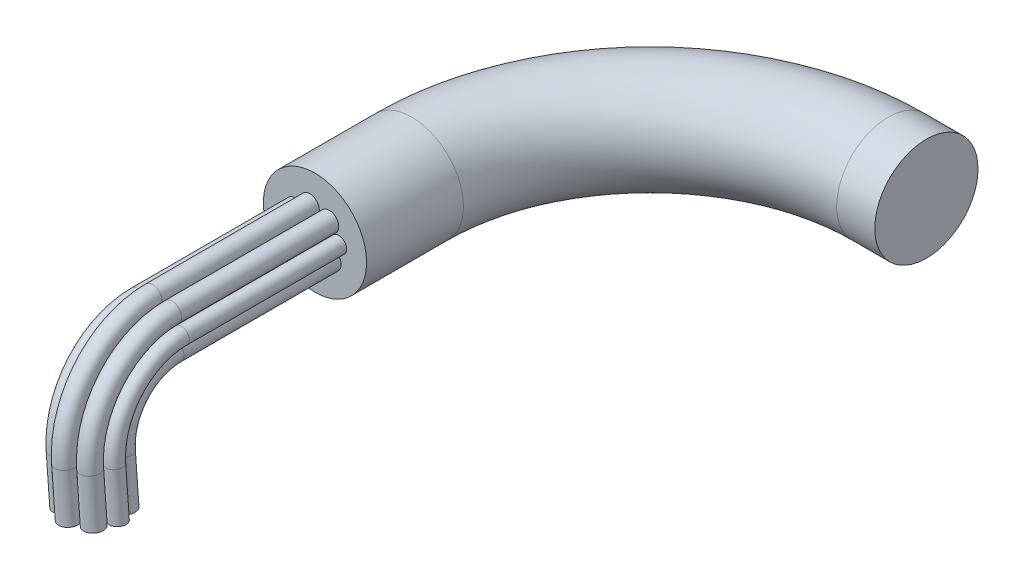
ISO-10303-21;
HEADER;
FILE_DESCRIPTION(('STEP AP214'),'2;1');
FILE_NAME('part.step','',(''),(''),'','','');
FILE_SCHEMA(('AUTOMOTIVE_DESIGN { 1 0 10303 214 1 1 1 1 }'));
ENDSEC;
DATA;
#1=APPLICATION_CONTEXT('core data for automotive mechanical design processes');
#2=APPLICATION_PROTOCOL_DEFINITION('international standard','automotive_design',2000,#1);
#3=PRODUCT_CONTEXT('',#1,'mechanical');
#4=PRODUCT('Part','Part','',(#3));
#5=PRODUCT_RELATED_PRODUCT_CATEGORY('part','',(#4));
#6=PRODUCT_DEFINITION_FORMATION('','',#4);
#7=PRODUCT_DEFINITION_CONTEXT('part definition',#1,'design');
#8=PRODUCT_DEFINITION('design','',#6,#7);
#9=PRODUCT_DEFINITION_SHAPE('','',#8);
#10=(LENGTH_UNIT() NAMED_UNIT(*) SI_UNIT(.MILLI.,.METRE.));
#11=(NAMED_UNIT(*) PLANE_ANGLE_UNIT() SI_UNIT($,.RADIAN.));
#12=(NAMED_UNIT(*) SI_UNIT($,.STERADIAN.) SOLID_ANGLE_UNIT());
#13=UNCERTAINTY_MEASURE_WITH_UNIT(LENGTH_MEASURE(1.E-05),#10,'distance_accuracy_value','');
#14=(GEOMETRIC_REPRESENTATION_CONTEXT(3) GLOBAL_UNCERTAINTY_ASSIGNED_CONTEXT((#13)) GLOBAL_UNIT_ASSIGNED_CONTEXT((#10,
#11,#12)) REPRESENTATION_CONTEXT('',''));
#15=CARTESIAN_POINT('',(0.,0.,0.));
#16=DIRECTION('',(0.,0.,1.));
#17=DIRECTION('',(1.,0.,0.));
#18=AXIS2_PLACEMENT_3D('',#15,#16,#17);
#19=CARTESIAN_POINT('',(1.30698490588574,-45.8187916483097,159.613254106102));
#20=DIRECTION('',(0.0761839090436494,-0.997093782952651,0.));
#21=DIRECTION('',(0.,0.,1.));
#22=AXIS2_PLACEMENT_3D('',#19,#20,#21);
#23=CYLINDRICAL_SURFACE('',#22,6.);
#24=CARTESIAN_POINT('',(1.30698490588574,-45.8187916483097,159.613254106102));
#25=DIRECTION('',(-0.0761839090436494,0.997093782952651,0.));
#26=DIRECTION('',(0.,0.,-1.));
#27=AXIS2_PLACEMENT_3D('',#24,#25,#26);
#28=CIRCLE('',#27,6.);
#29=CARTESIAN_POINT('',(1.30698490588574,-45.8187916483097,165.613254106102));
#30=VERTEX_POINT('',#29);
#31=EDGE_CURVE('E39',#30,#30,#28,.T.);
#32=CARTESIAN_POINT('',(3.59250217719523,-75.7316051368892,159.613254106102));
#33=DIRECTION('',(-0.0761839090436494,0.997093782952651,0.));
#34=DIRECTION('',(0.,0.,-1.));
#35=AXIS2_PLACEMENT_3D('',#32,#33,#34);
#36=CIRCLE('',#35,6.);
#37=CARTESIAN_POINT('',(3.59250217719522,-75.7316051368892,165.613254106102));
#38=VERTEX_POINT('',#37);
#39=EDGE_CURVE('E44',#38,#38,#36,.T.);
#40=CARTESIAN_POINT('',(1.30698490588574,-45.8187916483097,165.613254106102));
#41=CARTESIAN_POINT('',(1.33079237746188,-46.1303834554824,165.613254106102));
#42=CARTESIAN_POINT('',(1.35459984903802,-46.4419752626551,165.613254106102));
#43=CARTESIAN_POINT('',(1.4022147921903,-47.0651588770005,165.613254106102));
#44=CARTESIAN_POINT('',(1.42602226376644,-47.3767506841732,165.613254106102));
#45=CARTESIAN_POINT('',(1.47363720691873,-47.9999342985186,165.613254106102));
#46=CARTESIAN_POINT('',(1.49744467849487,-48.3115261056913,165.613254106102));
#47=CARTESIAN_POINT('',(1.54505962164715,-48.9347097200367,165.613254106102));
#48=CARTESIAN_POINT('',(1.56886709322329,-49.2463015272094,165.613254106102));
#49=CARTESIAN_POINT('',(1.61648203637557,-49.8694851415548,165.613254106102));
#50=CARTESIAN_POINT('',(1.64028950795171,-50.1810769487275,165.613254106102));
#51=CARTESIAN_POINT('',(1.68790445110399,-50.804260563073,165.613254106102));
#52=CARTESIAN_POINT('',(1.71171192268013,-51.1158523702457,165.613254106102));
#53=CARTESIAN_POINT('',(1.75932686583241,-51.7390359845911,165.613254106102));
#54=CARTESIAN_POINT('',(1.78313433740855,-52.0506277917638,165.613254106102));
#55=CARTESIAN_POINT('',(1.83074928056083,-52.6738114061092,165.613254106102));
#56=CARTESIAN_POINT('',(1.85455675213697,-52.9854032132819,165.613254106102));
#57=CARTESIAN_POINT('',(1.90217169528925,-53.6085868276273,165.613254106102));
#58=CARTESIAN_POINT('',(1.92597916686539,-53.9201786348,165.613254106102));
#59=CARTESIAN_POINT('',(1.97359411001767,-54.5433622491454,165.613254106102));
#60=CARTESIAN_POINT('',(1.99740158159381,-54.8549540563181,165.613254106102));
#61=CARTESIAN_POINT('',(2.0450165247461,-55.4781376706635,165.613254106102));
#62=CARTESIAN_POINT('',(2.06882399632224,-55.7897294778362,165.613254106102));
#63=CARTESIAN_POINT('',(2.11643893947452,-56.4129130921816,165.613254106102));
#64=CARTESIAN_POINT('',(2.14024641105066,-56.7245048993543,165.613254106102));
#65=CARTESIAN_POINT('',(2.18786135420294,-57.3476885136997,165.613254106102));
#66=CARTESIAN_POINT('',(2.21166882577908,-57.6592803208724,165.613254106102));
#67=CARTESIAN_POINT('',(2.25928376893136,-58.2824639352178,165.613254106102));
#68=CARTESIAN_POINT('',(2.2830912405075,-58.5940557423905,165.613254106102));
#69=CARTESIAN_POINT('',(2.33070618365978,-59.2172393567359,165.613254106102));
#70=CARTESIAN_POINT('',(2.35451365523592,-59.5288311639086,165.613254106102));
#71=CARTESIAN_POINT('',(2.4021285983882,-60.152014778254,165.613254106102));
#72=CARTESIAN_POINT('',(2.42593606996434,-60.4636065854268,165.613254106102));
#73=CARTESIAN_POINT('',(2.47355101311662,-61.0867901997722,165.613254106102));
#74=CARTESIAN_POINT('',(2.49735848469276,-61.3983820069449,165.613254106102));
#75=CARTESIAN_POINT('',(2.54497342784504,-62.0215656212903,165.613254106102));
#76=CARTESIAN_POINT('',(2.56878089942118,-62.333157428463,165.613254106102));
#77=CARTESIAN_POINT('',(2.61639584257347,-62.9563410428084,165.613254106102));
#78=CARTESIAN_POINT('',(2.64020331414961,-63.2679328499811,165.613254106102));
#79=CARTESIAN_POINT('',(2.68781825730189,-63.8911164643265,165.613254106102));
#80=CARTESIAN_POINT('',(2.71162572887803,-64.2027082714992,165.613254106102));
#81=CARTESIAN_POINT('',(2.75924067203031,-64.8258918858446,165.613254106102));
#82=CARTESIAN_POINT('',(2.78304814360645,-65.1374836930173,165.613254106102));
#83=CARTESIAN_POINT('',(2.83066308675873,-65.7606673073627,165.613254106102));
#84=CARTESIAN_POINT('',(2.85447055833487,-66.0722591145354,165.613254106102));
#85=CARTESIAN_POINT('',(2.90208550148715,-66.6954427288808,165.613254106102));
#86=CARTESIAN_POINT('',(2.92589297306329,-67.0070345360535,165.613254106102));
#87=CARTESIAN_POINT('',(2.97350791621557,-67.6302181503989,165.613254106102));
#88=CARTESIAN_POINT('',(2.99731538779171,-67.9418099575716,165.613254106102));
#89=CARTESIAN_POINT('',(3.04493033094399,-68.564993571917,165.613254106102));
#90=CARTESIAN_POINT('',(3.06873780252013,-68.8765853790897,165.613254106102));
#91=CARTESIAN_POINT('',(3.11635274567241,-69.4997689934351,165.613254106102));
#92=CARTESIAN_POINT('',(3.14016021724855,-69.8113608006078,165.613254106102));
#93=CARTESIAN_POINT('',(3.18777516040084,-70.4345444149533,165.613254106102));
#94=CARTESIAN_POINT('',(3.21158263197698,-70.746136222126,165.613254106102));
#95=CARTESIAN_POINT('',(3.25919757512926,-71.3693198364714,165.613254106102));
#96=CARTESIAN_POINT('',(3.2830050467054,-71.6809116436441,165.613254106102));
#97=CARTESIAN_POINT('',(3.33061998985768,-72.3040952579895,165.613254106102));
#98=CARTESIAN_POINT('',(3.35442746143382,-72.6156870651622,165.613254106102));
#99=CARTESIAN_POINT('',(3.4020424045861,-73.2388706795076,165.613254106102));
#100=CARTESIAN_POINT('',(3.42584987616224,-73.5504624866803,165.613254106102));
#101=CARTESIAN_POINT('',(3.47346481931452,-74.1736461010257,165.613254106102));
#102=CARTESIAN_POINT('',(3.49727229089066,-74.4852379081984,165.613254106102));
#103=CARTESIAN_POINT('',(3.54488723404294,-75.1084215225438,165.613254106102));
#104=CARTESIAN_POINT('',(3.56869470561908,-75.4200133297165,165.613254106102));
#105=CARTESIAN_POINT('',(3.59250217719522,-75.7316051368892,165.613254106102));
#106=B_SPLINE_CURVE_WITH_KNOTS('',3,(#40,#41,#42,#43,#44,#45,#46,#47,#48,#49,#50,#51,#52,#53,
#54,#55,#56,#57,#58,#59,#60,#61,#62,#63,#64,#65,#66,#67,#68,#69,#70,#71,#72,#73,#74,#75,#76,#77,
#78,#79,#80,#81,#82,#83,#84,#85,#86,#87,#88,#89,#90,#91,#92,#93,#94,#95,#96,#97,#98,#99,#100,
#101,#102,#103,#104,#105),.UNSPECIFIED.,.F.,.F.,(4,2,2,2,2,2,2,2,2,2,2,2,2,2,2,2,2,2,2,2,2,2,2,
2,2,2,2,2,2,2,2,2,4),(0.,0.9375,1.875,2.8125,3.75,4.68749999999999,5.62499999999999,
6.56249999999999,7.49999999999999,8.43749999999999,9.375,10.3125,11.25,12.1875,13.125,14.0625,
15.,15.9375,16.875,17.8125,18.75,19.6875,20.625,21.5625,22.5,23.4375,24.375,25.3125,26.25,
27.1875,28.125,29.0625,30.),.UNSPECIFIED.);
#107=EDGE_CURVE('BSEAM14',#30,#38,#106,.T.);
#108=ORIENTED_EDGE('',*,*,#31,.F.);
#109=ORIENTED_EDGE('',*,*,#39,.T.);
#110=ORIENTED_EDGE('',*,*,#107,.T.);
#111=ORIENTED_EDGE('',*,*,#107,.F.);
#112=EDGE_LOOP('',(#108,#110,#109,#111));
#113=FACE_BOUND('',#112,.T.);
#114=ADVANCED_FACE('F14',(#113),#23,.T.);
#115=CARTESIAN_POINT('',(1.30698490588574,-45.8187916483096,100.));
#116=DIRECTION('',(0.997093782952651,0.0761839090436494,0.));
#117=DIRECTION('',(0.,0.,-1.));
#118=AXIS2_PLACEMENT_3D('',#115,#116,#117);
#119=TOROIDAL_SURFACE('',#118,59.6132541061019,6.);
#120=CARTESIAN_POINT('',(-3.23458582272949,13.6212134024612,100.));
#121=DIRECTION('',(0.,0.,-1.));
#122=DIRECTION('',(0.0761839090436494,-0.997093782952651,0.));
#123=AXIS2_PLACEMENT_3D('',#120,#121,#122);
#124=CIRCLE('',#123,6.);
#125=CARTESIAN_POINT('',(-3.69168927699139,19.6037761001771,100.));
#126=VERTEX_POINT('',#125);
#127=EDGE_CURVE('E35',#126,#126,#124,.T.);
#128=CARTESIAN_POINT('',(1.30698490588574,-45.8187916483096,100.));
#129=DIRECTION('',(0.997093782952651,0.0761839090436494,0.));
#130=DIRECTION('',(0.,0.,-1.));
#131=AXIS2_PLACEMENT_3D('',#128,#129,#130);
#132=CIRCLE('',#131,65.6132541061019);
#133=EDGE_CURVE('',#126,#30,#132,.T.);
#134=ORIENTED_EDGE('',*,*,#127,.F.);
#135=ORIENTED_EDGE('',*,*,#31,.T.);
#136=ORIENTED_EDGE('',*,*,#133,.T.);
#137=ORIENTED_EDGE('',*,*,#133,.F.);
#138=EDGE_LOOP('',(#134,#136,#135,#137));
#139=FACE_BOUND('',#138,.T.);
#140=ADVANCED_FACE('F220',(#139),#119,.T.);
#141=CARTESIAN_POINT('',(-3.23458582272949,13.6212134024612,100.));
#142=DIRECTION('',(0.,0.,-1.));
#143=DIRECTION('',(0.0761839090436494,-0.997093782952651,0.));
#144=AXIS2_PLACEMENT_3D('',#141,#142,#143);
#145=CYLINDRICAL_SURFACE('',#144,6.);
#146=CARTESIAN_POINT('',(-3.2345858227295,13.6212134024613,1.));
#147=DIRECTION('',(0.,0.,1.));
#148=DIRECTION('',(1.,0.,0.));
#149=AXIS2_PLACEMENT_3D('',#146,#147,#148);
#150=CIRCLE('',#149,6.);
#151=CARTESIAN_POINT('',(2.76541417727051,13.6212134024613,1.));
#152=VERTEX_POINT('',#151);
#153=EDGE_CURVE('E10',#152,#152,#150,.F.);
#154=ORIENTED_EDGE('',*,*,#153,.F.);
#155=EDGE_LOOP('',(#154));
#156=FACE_BOUND('',#155,.T.);
#157=ORIENTED_EDGE('',*,*,#127,.T.);
#158=EDGE_LOOP('',(#157));
#159=FACE_BOUND('',#158,.T.);
#160=ADVANCED_FACE('F227',(#156,#159),#145,.T.);
#161=CARTESIAN_POINT('',(3.59250217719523,-75.7316051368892,159.613254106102));
#162=DIRECTION('',(-0.0761839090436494,0.997093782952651,0.));
#163=DIRECTION('',(0.,0.,-1.));
#164=AXIS2_PLACEMENT_3D('',#161,#162,#163);
#165=PLANE('',#164);
#166=ORIENTED_EDGE('',*,*,#39,.F.);
#167=EDGE_LOOP('',(#166));
#168=FACE_BOUND('',#167,.T.);
#169=ADVANCED_FACE('F561',(#168),#165,.F.);
#170=CARTESIAN_POINT('',(0.,0.,1.));
#171=DIRECTION('',(0.,0.,1.));
#172=DIRECTION('',(1.,0.,0.));
#173=AXIS2_PLACEMENT_3D('',#170,#171,#172);
#174=PLANE('',#173);
#175=ORIENTED_EDGE('',*,*,#153,.T.);
#176=EDGE_LOOP('',(#175));
#177=FACE_BOUND('',#176,.T.);
#178=CARTESIAN_POINT('',(-12.9153152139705,7.6285406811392,1.));
#179=DIRECTION('',(0.,0.,1.));
#180=DIRECTION('',(1.,0.,0.));
#181=AXIS2_PLACEMENT_3D('',#178,#179,#180);
#182=CIRCLE('',#181,5.);
#183=CARTESIAN_POINT('',(-7.9153152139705,7.6285406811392,1.));
#184=VERTEX_POINT('',#183);
#185=EDGE_CURVE('E23',#184,#184,#182,.F.);
#186=ORIENTED_EDGE('',*,*,#185,.T.);
#187=EDGE_LOOP('',(#186));
#188=FACE_BOUND('',#187,.T.);
#189=CARTESIAN_POINT('',(14.9671050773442,0.992857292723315,1.));
#190=DIRECTION('',(0.,0.,1.));
#191=DIRECTION('',(1.,0.,0.));
#192=AXIS2_PLACEMENT_3D('',#189,#190,#191);
#193=CIRCLE('',#192,5.);
#194=CARTESIAN_POINT('',(19.9671050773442,0.992857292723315,1.));
#195=VERTEX_POINT('',#194);
#196=EDGE_CURVE('E31',#195,#195,#193,.F.);
#197=ORIENTED_EDGE('',*,*,#196,.T.);
#198=EDGE_LOOP('',(#197));
#199=FACE_BOUND('',#198,.T.);
#200=CARTESIAN_POINT('',(-8.03427874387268E-13,-4.53557334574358E-13,1.));
#201=DIRECTION('',(0.,0.,1.));
#202=DIRECTION('',(1.,0.,0.));
#203=AXIS2_PLACEMENT_3D('',#200,#201,#202);
#204=CIRCLE('',#203,5.);
#205=CARTESIAN_POINT('',(4.9999999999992,-4.53557334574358E-13,1.));
#206=VERTEX_POINT('',#205);
#207=EDGE_CURVE('E178',#206,#206,#204,.F.);
#208=ORIENTED_EDGE('',*,*,#207,.T.);
#209=EDGE_LOOP('',(#208));
#210=FACE_BOUND('',#209,.T.);
#211=CARTESIAN_POINT('',(-14.668820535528,-3.13459791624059,1.));
#212=DIRECTION('',(0.,0.,1.));
#213=DIRECTION('',(1.,0.,0.));
#214=AXIS2_PLACEMENT_3D('',#211,#212,#213);
#215=CIRCLE('',#214,5.);
#216=CARTESIAN_POINT('',(-9.66882053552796,-3.13459791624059,1.));
#217=VERTEX_POINT('',#216);
#218=EDGE_CURVE('E175',#217,#217,#215,.F.);
#219=ORIENTED_EDGE('',*,*,#218,.T.);
#220=EDGE_LOOP('',(#219));
#221=FACE_BOUND('',#220,.T.);
#222=CARTESIAN_POINT('',(9.00764488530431,10.7173846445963,1.));
#223=DIRECTION('',(0.,0.,1.));
#224=DIRECTION('',(1.,0.,0.));
#225=AXIS2_PLACEMENT_3D('',#222,#223,#224);
#226=CIRCLE('',#225,6.);
#227=CARTESIAN_POINT('',(15.0076448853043,10.7173846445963,1.));
#228=VERTEX_POINT('',#227);
#229=EDGE_CURVE('E171',#228,#228,#226,.F.);
#230=ORIENTED_EDGE('',*,*,#229,.T.);
#231=EDGE_LOOP('',(#230));
#232=FACE_BOUND('',#231,.T.);
#233=CARTESIAN_POINT('',(10.5313230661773,-9.22449101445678,1.));
#234=DIRECTION('',(0.,0.,1.));
#235=DIRECTION('',(1.,0.,0.));
#236=AXIS2_PLACEMENT_3D('',#233,#234,#235);
#237=CIRCLE('',#236,6.);
#238=CARTESIAN_POINT('',(16.5313230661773,-9.22449101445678,1.));
#239=VERTEX_POINT('',#238);
#240=EDGE_CURVE('E168',#239,#239,#237,.F.);
#241=ORIENTED_EDGE('',*,*,#240,.T.);
#242=EDGE_LOOP('',(#241));
#243=FACE_BOUND('',#242,.T.);
#244=CARTESIAN_POINT('',(-7.72737774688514,-11.6742294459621,1.));
#245=DIRECTION('',(0.,0.,1.));
#246=DIRECTION('',(1.,0.,0.));
#247=AXIS2_PLACEMENT_3D('',#244,#245,#246);
#248=CIRCLE('',#247,6.);
#249=CARTESIAN_POINT('',(-1.72737774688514,-11.6742294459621,1.));
#250=VERTEX_POINT('',#249);
#251=EDGE_CURVE('E164',#250,#250,#248,.F.);
#252=ORIENTED_EDGE('',*,*,#251,.T.);
#253=EDGE_LOOP('',(#252));
#254=FACE_BOUND('',#253,.T.);
#255=CARTESIAN_POINT('',(1.77362238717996,-18.1943641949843,1.));
#256=DIRECTION('',(0.,0.,1.));
#257=DIRECTION('',(1.,0.,0.));
#258=AXIS2_PLACEMENT_3D('',#255,#256,#257);
#259=CIRCLE('',#258,5.);
#260=CARTESIAN_POINT('',(6.77362238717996,-18.1943641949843,1.));
#261=VERTEX_POINT('',#260);
#262=EDGE_CURVE('E18',#261,#261,#259,.F.);
#263=ORIENTED_EDGE('',*,*,#262,.T.);
#264=EDGE_LOOP('',(#263));
#265=FACE_BOUND('',#264,.T.);
#266=CARTESIAN_POINT('',(0.,0.,1.));
#267=DIRECTION('',(0.,0.,1.));
#268=DIRECTION('',(1.,0.,0.));
#269=AXIS2_PLACEMENT_3D('',#266,#267,#268);
#270=CIRCLE('',#269,32.5);
#271=CARTESIAN_POINT('',(32.5,0.,1.));
#272=VERTEX_POINT('',#271);
#273=EDGE_CURVE('E153',#272,#272,#270,.T.);
#274=ORIENTED_EDGE('',*,*,#273,.T.);
#275=EDGE_LOOP('',(#274));
#276=FACE_BOUND('',#275,.T.);
#277=ADVANCED_FACE('F184',(#177,#188,#199,#210,#221,#232,#243,#254,#265,#276),#174,.T.);
#278=CARTESIAN_POINT('',(6.15485192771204,-75.5358263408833,127.508594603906));
#279=DIRECTION('',(-0.0761839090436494,0.997093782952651,0.));
#280=DIRECTION('',(0.,0.,-1.));
#281=AXIS2_PLACEMENT_3D('',#278,#279,#280);
#282=PLANE('',#281);
#283=CARTESIAN_POINT('',(6.15485192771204,-75.5358263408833,127.508594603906));
#284=DIRECTION('',(-0.0761839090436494,0.997093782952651,0.));
#285=DIRECTION('',(0.,0.,-1.));
#286=AXIS2_PLACEMENT_3D('',#283,#284,#285);
#287=CIRCLE('',#286,5.);
#288=CARTESIAN_POINT('',(6.15485192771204,-75.5358263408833,132.508594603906));
#289=VERTEX_POINT('',#288);
#290=EDGE_CURVE('E40',#289,#289,#287,.T.);
#291=ORIENTED_EDGE('',*,*,#290,.F.);
#292=EDGE_LOOP('',(#291));
#293=FACE_BOUND('',#292,.T.);
#294=ADVANCED_FACE('F234',(#293),#282,.F.);
#295=CARTESIAN_POINT('',(3.86933465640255,-45.6230128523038,127.508594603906));
#296=DIRECTION('',(0.0761839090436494,-0.997093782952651,0.));
#297=DIRECTION('',(0.,0.,1.));
#298=AXIS2_PLACEMENT_3D('',#295,#296,#297);
#299=CYLINDRICAL_SURFACE('',#298,5.);
#300=CARTESIAN_POINT('',(3.86933465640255,-45.6230128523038,127.508594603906));
#301=DIRECTION('',(-0.0761839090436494,0.997093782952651,0.));
#302=DIRECTION('',(0.,0.,-1.));
#303=AXIS2_PLACEMENT_3D('',#300,#301,#302);
#304=CIRCLE('',#303,5.);
#305=CARTESIAN_POINT('',(3.86933465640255,-45.6230128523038,132.508594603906));
#306=VERTEX_POINT('',#305);
#307=EDGE_CURVE('E52',#306,#306,#304,.T.);
#308=CARTESIAN_POINT('',(3.86933465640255,-45.6230128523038,132.508594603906));
#309=CARTESIAN_POINT('',(3.8931421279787,-45.9346046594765,132.508594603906));
#310=CARTESIAN_POINT('',(3.91694959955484,-46.2461964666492,132.508594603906));
#311=CARTESIAN_POINT('',(3.96456454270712,-46.8693800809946,132.508594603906));
#312=CARTESIAN_POINT('',(3.98837201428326,-47.1809718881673,132.508594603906));
#313=CARTESIAN_POINT('',(4.03598695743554,-47.8041555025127,132.508594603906));
#314=CARTESIAN_POINT('',(4.05979442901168,-48.1157473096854,132.508594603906));
#315=CARTESIAN_POINT('',(4.10740937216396,-48.7389309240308,132.508594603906));
#316=CARTESIAN_POINT('',(4.1312168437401,-49.0505227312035,132.508594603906));
#317=CARTESIAN_POINT('',(4.17883178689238,-49.673706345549,132.508594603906));
#318=CARTESIAN_POINT('',(4.20263925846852,-49.9852981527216,132.508594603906));
#319=CARTESIAN_POINT('',(4.2502542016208,-50.6084817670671,132.508594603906));
#320=CARTESIAN_POINT('',(4.27406167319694,-50.9200735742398,132.508594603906));
#321=CARTESIAN_POINT('',(4.32167661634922,-51.5432571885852,132.508594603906));
#322=CARTESIAN_POINT('',(4.34548408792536,-51.8548489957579,132.508594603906));
#323=CARTESIAN_POINT('',(4.39309903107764,-52.4780326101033,132.508594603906));
#324=CARTESIAN_POINT('',(4.41690650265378,-52.789624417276,132.508594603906));
#325=CARTESIAN_POINT('',(4.46452144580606,-53.4128080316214,132.508594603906));
#326=CARTESIAN_POINT('',(4.48832891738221,-53.7243998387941,132.508594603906));
#327=CARTESIAN_POINT('',(4.53594386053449,-54.3475834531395,132.508594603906));
#328=CARTESIAN_POINT('',(4.55975133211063,-54.6591752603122,132.508594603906));
#329=CARTESIAN_POINT('',(4.60736627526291,-55.2823588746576,132.508594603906));
#330=CARTESIAN_POINT('',(4.63117374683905,-55.5939506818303,132.508594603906));
#331=CARTESIAN_POINT('',(4.67878868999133,-56.2171342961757,132.508594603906));
#332=CARTESIAN_POINT('',(4.70259616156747,-56.5287261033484,132.508594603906));
#333=CARTESIAN_POINT('',(4.75021110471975,-57.1519097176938,132.508594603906));
#334=CARTESIAN_POINT('',(4.77401857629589,-57.4635015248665,132.508594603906));
#335=CARTESIAN_POINT('',(4.82163351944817,-58.0866851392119,132.508594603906));
#336=CARTESIAN_POINT('',(4.84544099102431,-58.3982769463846,132.508594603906));
#337=CARTESIAN_POINT('',(4.89305593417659,-59.02146056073,132.508594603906));
#338=CARTESIAN_POINT('',(4.91686340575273,-59.3330523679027,132.508594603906));
#339=CARTESIAN_POINT('',(4.96447834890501,-59.9562359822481,132.508594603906));
#340=CARTESIAN_POINT('',(4.98828582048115,-60.2678277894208,132.508594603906));
#341=CARTESIAN_POINT('',(5.03590076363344,-60.8910114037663,132.508594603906));
#342=CARTESIAN_POINT('',(5.05970823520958,-61.202603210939,132.508594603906));
#343=CARTESIAN_POINT('',(5.10732317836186,-61.8257868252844,132.508594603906));
#344=CARTESIAN_POINT('',(5.131130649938,-62.1373786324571,132.508594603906));
#345=CARTESIAN_POINT('',(5.17874559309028,-62.7605622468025,132.508594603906));
#346=CARTESIAN_POINT('',(5.20255306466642,-63.0721540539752,132.508594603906));
#347=CARTESIAN_POINT('',(5.2501680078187,-63.6953376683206,132.508594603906));
#348=CARTESIAN_POINT('',(5.27397547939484,-64.0069294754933,132.508594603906));
#349=CARTESIAN_POINT('',(5.32159042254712,-64.6301130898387,132.508594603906));
#350=CARTESIAN_POINT('',(5.34539789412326,-64.9417048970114,132.508594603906));
#351=CARTESIAN_POINT('',(5.39301283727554,-65.5648885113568,132.508594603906));
#352=CARTESIAN_POINT('',(5.41682030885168,-65.8764803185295,132.508594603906));
#353=CARTESIAN_POINT('',(5.46443525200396,-66.4996639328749,132.508594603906));
#354=CARTESIAN_POINT('',(5.4882427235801,-66.8112557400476,132.508594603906));
#355=CARTESIAN_POINT('',(5.53585766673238,-67.434439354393,132.508594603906));
#356=CARTESIAN_POINT('',(5.55966513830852,-67.7460311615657,132.508594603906));
#357=CARTESIAN_POINT('',(5.6072800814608,-68.3692147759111,132.508594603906));
#358=CARTESIAN_POINT('',(5.63108755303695,-68.6808065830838,132.508594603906));
#359=CARTESIAN_POINT('',(5.67870249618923,-69.3039901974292,132.508594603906));
#360=CARTESIAN_POINT('',(5.70250996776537,-69.6155820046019,132.508594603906));
#361=CARTESIAN_POINT('',(5.75012491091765,-70.2387656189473,132.508594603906));
#362=CARTESIAN_POINT('',(5.77393238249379,-70.55035742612,132.508594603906));
#363=CARTESIAN_POINT('',(5.82154732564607,-71.1735410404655,132.508594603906));
#364=CARTESIAN_POINT('',(5.84535479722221,-71.4851328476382,132.508594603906));
#365=CARTESIAN_POINT('',(5.89296974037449,-72.1083164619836,132.508594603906));
#366=CARTESIAN_POINT('',(5.91677721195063,-72.4199082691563,132.508594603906));
#367=CARTESIAN_POINT('',(5.96439215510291,-73.0430918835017,132.508594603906));
#368=CARTESIAN_POINT('',(5.98819962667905,-73.3546836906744,132.508594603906));
#369=CARTESIAN_POINT('',(6.03581456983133,-73.9778673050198,132.508594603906));
#370=CARTESIAN_POINT('',(6.05962204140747,-74.2894591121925,132.508594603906));
#371=CARTESIAN_POINT('',(6.10723698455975,-74.9126427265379,132.508594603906));
#372=CARTESIAN_POINT('',(6.13104445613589,-75.2242345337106,132.508594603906));
#373=CARTESIAN_POINT('',(6.15485192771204,-75.5358263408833,132.508594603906));
#374=B_SPLINE_CURVE_WITH_KNOTS('',3,(#308,#309,#310,#311,#312,#313,#314,#315,#316,#317,#318,
#319,#320,#321,#322,#323,#324,#325,#326,#327,#328,#329,#330,#331,#332,#333,#334,#335,#336,#337,
#338,#339,#340,#341,#342,#343,#344,#345,#346,#347,#348,#349,#350,#351,#352,#353,#354,#355,#356,
#357,#358,#359,#360,#361,#362,#363,#364,#365,#366,#367,#368,#369,#370,#371,#372,#373),
.UNSPECIFIED.,.F.,.F.,(4,2,2,2,2,2,2,2,2,2,2,2,2,2,2,2,2,2,2,2,2,2,2,2,2,2,2,2,2,2,2,2,4),(0.,
0.937499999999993,1.87499999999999,2.81249999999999,3.74999999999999,4.68749999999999,
5.62499999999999,6.56249999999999,7.49999999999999,8.43749999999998,9.37499999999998,10.3125,
11.25,12.1875,13.125,14.0625,15.,15.9375,16.875,17.8125,18.75,19.6875,20.625,21.5625,22.5,
23.4375,24.375,25.3125,26.25,27.1875,28.125,29.0625,30.),.UNSPECIFIED.);
#375=EDGE_CURVE('BSEAM237',#306,#289,#374,.T.);
#376=ORIENTED_EDGE('',*,*,#307,.F.);
#377=ORIENTED_EDGE('',*,*,#290,.T.);
#378=ORIENTED_EDGE('',*,*,#375,.T.);
#379=ORIENTED_EDGE('',*,*,#375,.F.);
#380=EDGE_LOOP('',(#376,#378,#377,#379));
#381=FACE_BOUND('',#380,.T.);
#382=ADVANCED_FACE('F237',(#381),#299,.T.);
#383=CARTESIAN_POINT('',(3.86933465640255,-45.6230128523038,100.));
#384=DIRECTION('',(0.997093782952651,0.0761839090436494,0.));
#385=DIRECTION('',(0.,0.,-1.));
#386=AXIS2_PLACEMENT_3D('',#383,#384,#385);
#387=TOROIDAL_SURFACE('',#386,27.5085946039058,5.);
#388=CARTESIAN_POINT('',(1.77362238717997,-18.1943641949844,100.));
#389=DIRECTION('',(0.,0.,-1.));
#390=DIRECTION('',(0.0761839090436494,-0.997093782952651,0.));
#391=AXIS2_PLACEMENT_3D('',#388,#389,#390);
#392=CIRCLE('',#391,5.);
#393=CARTESIAN_POINT('',(1.39270284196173,-13.2088952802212,100.));
#394=VERTEX_POINT('',#393);
#395=EDGE_CURVE('E48',#394,#394,#392,.T.);
#396=CARTESIAN_POINT('',(3.86933465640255,-45.6230128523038,100.));
#397=DIRECTION('',(0.997093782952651,0.0761839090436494,0.));
#398=DIRECTION('',(0.,0.,-1.));
#399=AXIS2_PLACEMENT_3D('',#396,#397,#398);
#400=CIRCLE('',#399,32.5085946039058);
#401=EDGE_CURVE('',#394,#306,#400,.T.);
#402=ORIENTED_EDGE('',*,*,#395,.F.);
#403=ORIENTED_EDGE('',*,*,#307,.T.);
#404=ORIENTED_EDGE('',*,*,#401,.T.);
#405=ORIENTED_EDGE('',*,*,#401,.F.);
#406=EDGE_LOOP('',(#402,#404,#403,#405));
#407=FACE_BOUND('',#406,.T.);
#408=ADVANCED_FACE('F243',(#407),#387,.T.);
#409=CARTESIAN_POINT('',(1.77362238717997,-18.1943641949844,100.));
#410=DIRECTION('',(0.,0.,-1.));
#411=DIRECTION('',(0.0761839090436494,-0.997093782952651,0.));
#412=AXIS2_PLACEMENT_3D('',#409,#410,#411);
#413=CYLINDRICAL_SURFACE('',#412,5.);
#414=ORIENTED_EDGE('',*,*,#262,.F.);
#415=EDGE_LOOP('',(#414));
#416=FACE_BOUND('',#415,.T.);
#417=ORIENTED_EDGE('',*,*,#395,.T.);
#418=EDGE_LOOP('',(#417));
#419=FACE_BOUND('',#418,.T.);
#420=ADVANCED_FACE('F239',(#416,#419),#413,.T.);
#421=CARTESIAN_POINT('',(-2.79571876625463,-76.2197032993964,134.733603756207));
#422=DIRECTION('',(-0.0761839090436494,0.997093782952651,0.));
#423=DIRECTION('',(0.,0.,-1.));
#424=AXIS2_PLACEMENT_3D('',#421,#422,#423);
#425=PLANE('',#424);
#426=CARTESIAN_POINT('',(-2.79571876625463,-76.2197032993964,134.733603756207));
#427=DIRECTION('',(-0.0761839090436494,0.997093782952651,0.));
#428=DIRECTION('',(0.,0.,-1.));
#429=AXIS2_PLACEMENT_3D('',#426,#427,#428);
#430=CIRCLE('',#429,6.);
#431=CARTESIAN_POINT('',(-2.79571876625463,-76.2197032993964,140.733603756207));
#432=VERTEX_POINT('',#431);
#433=EDGE_CURVE('E53',#432,#432,#430,.T.);
#434=ORIENTED_EDGE('',*,*,#433,.F.);
#435=EDGE_LOOP('',(#434));
#436=FACE_BOUND('',#435,.T.);
#437=ADVANCED_FACE('F242',(#436),#425,.F.);
#438=CARTESIAN_POINT('',(-5.08123603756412,-46.3068898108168,134.733603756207));
#439=DIRECTION('',(0.0761839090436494,-0.997093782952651,0.));
#440=DIRECTION('',(0.,0.,1.));
#441=AXIS2_PLACEMENT_3D('',#438,#439,#440);
#442=CYLINDRICAL_SURFACE('',#441,6.);
#443=CARTESIAN_POINT('',(-5.08123603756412,-46.3068898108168,134.733603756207));
#444=DIRECTION('',(-0.0761839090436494,0.997093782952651,0.));
#445=DIRECTION('',(0.,0.,-1.));
#446=AXIS2_PLACEMENT_3D('',#443,#444,#445);
#447=CIRCLE('',#446,6.);
#448=CARTESIAN_POINT('',(-5.08123603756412,-46.3068898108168,140.733603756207));
#449=VERTEX_POINT('',#448);
#450=EDGE_CURVE('E64',#449,#449,#447,.T.);
#451=CARTESIAN_POINT('',(-5.08123603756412,-46.3068898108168,140.733603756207));
#452=CARTESIAN_POINT('',(-5.05742856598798,-46.6184816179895,140.733603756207));
#453=CARTESIAN_POINT('',(-5.03362109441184,-46.9300734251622,140.733603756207));
#454=CARTESIAN_POINT('',(-4.98600615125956,-47.5532570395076,140.733603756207));
#455=CARTESIAN_POINT('',(-4.96219867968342,-47.8648488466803,140.733603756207));
#456=CARTESIAN_POINT('',(-4.91458373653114,-48.4880324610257,140.733603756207));
#457=CARTESIAN_POINT('',(-4.890776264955,-48.7996242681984,140.733603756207));
#458=CARTESIAN_POINT('',(-4.84316132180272,-49.4228078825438,140.733603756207));
#459=CARTESIAN_POINT('',(-4.81935385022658,-49.7343996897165,140.733603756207));
#460=CARTESIAN_POINT('',(-4.77173890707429,-50.357583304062,140.733603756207));
#461=CARTESIAN_POINT('',(-4.74793143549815,-50.6691751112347,140.733603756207));
#462=CARTESIAN_POINT('',(-4.70031649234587,-51.2923587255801,140.733603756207));
#463=CARTESIAN_POINT('',(-4.67650902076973,-51.6039505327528,140.733603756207));
#464=CARTESIAN_POINT('',(-4.62889407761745,-52.2271341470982,140.733603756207));
#465=CARTESIAN_POINT('',(-4.60508660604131,-52.5387259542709,140.733603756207));
#466=CARTESIAN_POINT('',(-4.55747166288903,-53.1619095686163,140.733603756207));
#467=CARTESIAN_POINT('',(-4.53366419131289,-53.473501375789,140.733603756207));
#468=CARTESIAN_POINT('',(-4.48604924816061,-54.0966849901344,140.733603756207));
#469=CARTESIAN_POINT('',(-4.46224177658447,-54.4082767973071,140.733603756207));
#470=CARTESIAN_POINT('',(-4.41462683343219,-55.0314604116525,140.733603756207));
#471=CARTESIAN_POINT('',(-4.39081936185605,-55.3430522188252,140.733603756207));
#472=CARTESIAN_POINT('',(-4.34320441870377,-55.9662358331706,140.733603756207));
#473=CARTESIAN_POINT('',(-4.31939694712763,-56.2778276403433,140.733603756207));
#474=CARTESIAN_POINT('',(-4.27178200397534,-56.9010112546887,140.733603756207));
#475=CARTESIAN_POINT('',(-4.2479745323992,-57.2126030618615,140.733603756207));
#476=CARTESIAN_POINT('',(-4.20035958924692,-57.8357866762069,140.733603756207));
#477=CARTESIAN_POINT('',(-4.17655211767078,-58.1473784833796,140.733603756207));
#478=CARTESIAN_POINT('',(-4.1289371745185,-58.770562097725,140.733603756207));
#479=CARTESIAN_POINT('',(-4.10512970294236,-59.0821539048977,140.733603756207));
#480=CARTESIAN_POINT('',(-4.05751475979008,-59.7053375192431,140.733603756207));
#481=CARTESIAN_POINT('',(-4.03370728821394,-60.0169293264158,140.733603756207));
#482=CARTESIAN_POINT('',(-3.98609234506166,-60.6401129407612,140.733603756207));
#483=CARTESIAN_POINT('',(-3.96228487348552,-60.9517047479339,140.733603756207));
#484=CARTESIAN_POINT('',(-3.91466993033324,-61.5748883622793,140.733603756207));
#485=CARTESIAN_POINT('',(-3.8908624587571,-61.886480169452,140.733603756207));
#486=CARTESIAN_POINT('',(-3.84324751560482,-62.5096637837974,140.733603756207));
#487=CARTESIAN_POINT('',(-3.81944004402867,-62.8212555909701,140.733603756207));
#488=CARTESIAN_POINT('',(-3.77182510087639,-63.4444392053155,140.733603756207));
#489=CARTESIAN_POINT('',(-3.74801762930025,-63.7560310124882,140.733603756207));
#490=CARTESIAN_POINT('',(-3.70040268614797,-64.3792146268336,140.733603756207));
#491=CARTESIAN_POINT('',(-3.67659521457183,-64.6908064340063,140.733603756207));
#492=CARTESIAN_POINT('',(-3.62898027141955,-65.3139900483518,140.733603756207));
#493=CARTESIAN_POINT('',(-3.60517279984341,-65.6255818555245,140.733603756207));
#494=CARTESIAN_POINT('',(-3.55755785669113,-66.2487654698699,140.733603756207));
#495=CARTESIAN_POINT('',(-3.53375038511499,-66.5603572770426,140.733603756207));
#496=CARTESIAN_POINT('',(-3.48613544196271,-67.183540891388,140.733603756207));
#497=CARTESIAN_POINT('',(-3.46232797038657,-67.4951326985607,140.733603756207));
#498=CARTESIAN_POINT('',(-3.41471302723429,-68.1183163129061,140.733603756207));
#499=CARTESIAN_POINT('',(-3.39090555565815,-68.4299081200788,140.733603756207));
#500=CARTESIAN_POINT('',(-3.34329061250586,-69.0530917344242,140.733603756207));
#501=CARTESIAN_POINT('',(-3.31948314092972,-69.3646835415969,140.733603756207));
#502=CARTESIAN_POINT('',(-3.27186819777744,-69.9878671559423,140.733603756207));
#503=CARTESIAN_POINT('',(-3.2480607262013,-70.299458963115,140.733603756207));
#504=CARTESIAN_POINT('',(-3.20044578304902,-70.9226425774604,140.733603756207));
#505=CARTESIAN_POINT('',(-3.17663831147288,-71.2342343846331,140.733603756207));
#506=CARTESIAN_POINT('',(-3.1290233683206,-71.8574179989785,140.733603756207));
#507=CARTESIAN_POINT('',(-3.10521589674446,-72.1690098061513,140.733603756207));
#508=CARTESIAN_POINT('',(-3.05760095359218,-72.7921934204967,140.733603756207));
#509=CARTESIAN_POINT('',(-3.03379348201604,-73.1037852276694,140.733603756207));
#510=CARTESIAN_POINT('',(-2.98617853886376,-73.7269688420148,140.733603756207));
#511=CARTESIAN_POINT('',(-2.96237106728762,-74.0385606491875,140.733603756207));
#512=CARTESIAN_POINT('',(-2.91475612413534,-74.6617442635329,140.733603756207));
#513=CARTESIAN_POINT('',(-2.89094865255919,-74.9733360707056,140.733603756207));
#514=CARTESIAN_POINT('',(-2.84333370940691,-75.596519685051,140.733603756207));
#515=CARTESIAN_POINT('',(-2.81952623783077,-75.9081114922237,140.733603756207));
#516=CARTESIAN_POINT('',(-2.79571876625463,-76.2197032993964,140.733603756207));
#517=B_SPLINE_CURVE_WITH_KNOTS('',3,(#451,#452,#453,#454,#455,#456,#457,#458,#459,#460,#461,
#462,#463,#464,#465,#466,#467,#468,#469,#470,#471,#472,#473,#474,#475,#476,#477,#478,#479,#480,
#481,#482,#483,#484,#485,#486,#487,#488,#489,#490,#491,#492,#493,#494,#495,#496,#497,#498,#499,
#500,#501,#502,#503,#504,#505,#506,#507,#508,#509,#510,#511,#512,#513,#514,#515,#516),
.UNSPECIFIED.,.F.,.F.,(4,2,2,2,2,2,2,2,2,2,2,2,2,2,2,2,2,2,2,2,2,2,2,2,2,2,2,2,2,2,2,2,4),(0.,
0.937500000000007,1.87500000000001,2.81250000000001,3.75000000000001,4.68750000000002,
5.62500000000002,6.56250000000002,7.50000000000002,8.43750000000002,9.37500000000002,10.3125,
11.25,12.1875,13.125,14.0625,15.,15.9375,16.875,17.8125,18.75,19.6875,20.625,21.5625,
22.5000000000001,23.4375,24.3750000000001,25.3125000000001,26.2500000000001,27.1875000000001,
28.1250000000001,29.0625000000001,30.0000000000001),.UNSPECIFIED.);
#518=EDGE_CURVE('BSEAM253',#449,#432,#517,.T.);
#519=ORIENTED_EDGE('',*,*,#450,.F.);
#520=ORIENTED_EDGE('',*,*,#433,.T.);
#521=ORIENTED_EDGE('',*,*,#518,.T.);
#522=ORIENTED_EDGE('',*,*,#518,.F.);
#523=EDGE_LOOP('',(#519,#521,#520,#522));
#524=FACE_BOUND('',#523,.T.);
#525=ADVANCED_FACE('F253',(#524),#442,.T.);
#526=CARTESIAN_POINT('',(-5.08123603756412,-46.3068898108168,100.));
#527=DIRECTION('',(0.997093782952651,0.0761839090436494,0.));
#528=DIRECTION('',(0.,0.,-1.));
#529=AXIS2_PLACEMENT_3D('',#526,#527,#528);
#530=TOROIDAL_SURFACE('',#529,34.7336037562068,6.);
#531=CARTESIAN_POINT('',(-7.72737774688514,-11.6742294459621,100.));
#532=DIRECTION('',(0.,0.,-1.));
#533=DIRECTION('',(0.0761839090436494,-0.997093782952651,0.));
#534=AXIS2_PLACEMENT_3D('',#531,#532,#533);
#535=CIRCLE('',#534,6.);
#536=CARTESIAN_POINT('',(-8.18448120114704,-5.69166674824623,100.));
#537=VERTEX_POINT('',#536);
#538=EDGE_CURVE('E60',#537,#537,#535,.T.);
#539=CARTESIAN_POINT('',(-5.08123603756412,-46.3068898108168,100.));
#540=DIRECTION('',(0.997093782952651,0.0761839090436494,0.));
#541=DIRECTION('',(0.,0.,-1.));
#542=AXIS2_PLACEMENT_3D('',#539,#540,#541);
#543=CIRCLE('',#542,40.7336037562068);
#544=EDGE_CURVE('',#537,#449,#543,.T.);
#545=ORIENTED_EDGE('',*,*,#538,.F.);
#546=ORIENTED_EDGE('',*,*,#450,.T.);
#547=ORIENTED_EDGE('',*,*,#544,.T.);
#548=ORIENTED_EDGE('',*,*,#544,.F.);
#549=EDGE_LOOP('',(#545,#547,#546,#548));
#550=FACE_BOUND('',#549,.T.);
#551=ADVANCED_FACE('F259',(#550),#530,.T.);
#552=CARTESIAN_POINT('',(-7.72737774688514,-11.6742294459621,100.));
#553=DIRECTION('',(0.,0.,-1.));
#554=DIRECTION('',(0.0761839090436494,-0.997093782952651,0.));
#555=AXIS2_PLACEMENT_3D('',#552,#553,#554);
#556=CYLINDRICAL_SURFACE('',#555,6.);
#557=ORIENTED_EDGE('',*,*,#251,.F.);
#558=EDGE_LOOP('',(#557));
#559=FACE_BOUND('',#558,.T.);
#560=ORIENTED_EDGE('',*,*,#538,.T.);
#561=EDGE_LOOP('',(#560));
#562=FACE_BOUND('',#561,.T.);
#563=ADVANCED_FACE('F255',(#559,#562),#556,.T.);
#564=CARTESIAN_POINT('',(15.5430970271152,-74.8185084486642,135.785203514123));
#565=DIRECTION('',(-0.0761839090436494,0.997093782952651,0.));
#566=DIRECTION('',(0.,0.,-1.));
#567=AXIS2_PLACEMENT_3D('',#564,#565,#566);
#568=PLANE('',#567);
#569=CARTESIAN_POINT('',(15.5430970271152,-74.8185084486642,135.785203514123));
#570=DIRECTION('',(-0.0761839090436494,0.997093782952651,0.));
#571=DIRECTION('',(0.,0.,-1.));
#572=AXIS2_PLACEMENT_3D('',#569,#570,#571);
#573=CIRCLE('',#572,6.);
#574=CARTESIAN_POINT('',(15.5430970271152,-74.8185084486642,141.785203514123));
#575=VERTEX_POINT('',#574);
#576=EDGE_CURVE('E65',#575,#575,#573,.T.);
#577=ORIENTED_EDGE('',*,*,#576,.F.);
#578=EDGE_LOOP('',(#577));
#579=FACE_BOUND('',#578,.T.);
#580=ADVANCED_FACE('F258',(#579),#568,.F.);
#581=CARTESIAN_POINT('',(13.2575797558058,-44.9056949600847,135.785203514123));
#582=DIRECTION('',(0.0761839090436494,-0.997093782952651,0.));
#583=DIRECTION('',(0.,0.,1.));
#584=AXIS2_PLACEMENT_3D('',#581,#582,#583);
#585=CYLINDRICAL_SURFACE('',#584,6.);
#586=CARTESIAN_POINT('',(13.2575797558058,-44.9056949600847,135.785203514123));
#587=DIRECTION('',(-0.0761839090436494,0.997093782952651,0.));
#588=DIRECTION('',(0.,0.,-1.));
#589=AXIS2_PLACEMENT_3D('',#586,#587,#588);
#590=CIRCLE('',#589,6.);
#591=CARTESIAN_POINT('',(13.2575797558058,-44.9056949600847,141.785203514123));
#592=VERTEX_POINT('',#591);
#593=EDGE_CURVE('E76',#592,#592,#590,.T.);
#594=CARTESIAN_POINT('',(13.2575797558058,-44.9056949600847,141.785203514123));
#595=CARTESIAN_POINT('',(13.2813872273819,-45.2172867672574,141.785203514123));
#596=CARTESIAN_POINT('',(13.305194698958,-45.5288785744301,141.785203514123));
#597=CARTESIAN_POINT('',(13.3528096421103,-46.1520621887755,141.785203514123));
#598=CARTESIAN_POINT('',(13.3766171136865,-46.4636539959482,141.785203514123));
#599=CARTESIAN_POINT('',(13.4242320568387,-47.0868376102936,141.785203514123));
#600=CARTESIAN_POINT('',(13.4480395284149,-47.3984294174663,141.785203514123));
#601=CARTESIAN_POINT('',(13.4956544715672,-48.0216130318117,141.785203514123));
#602=CARTESIAN_POINT('',(13.5194619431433,-48.3332048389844,141.785203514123));
#603=CARTESIAN_POINT('',(13.5670768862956,-48.9563884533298,141.785203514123));
#604=CARTESIAN_POINT('',(13.5908843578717,-49.2679802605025,141.785203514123));
#605=CARTESIAN_POINT('',(13.638499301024,-49.8911638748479,141.785203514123));
#606=CARTESIAN_POINT('',(13.6623067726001,-50.2027556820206,141.785203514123));
#607=CARTESIAN_POINT('',(13.7099217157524,-50.825939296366,141.785203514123));
#608=CARTESIAN_POINT('',(13.7337291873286,-51.1375311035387,141.785203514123));
#609=CARTESIAN_POINT('',(13.7813441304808,-51.7607147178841,141.785203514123));
#610=CARTESIAN_POINT('',(13.805151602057,-52.0723065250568,141.785203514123));
#611=CARTESIAN_POINT('',(13.8527665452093,-52.6954901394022,141.785203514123));
#612=CARTESIAN_POINT('',(13.8765740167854,-53.0070819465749,141.785203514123));
#613=CARTESIAN_POINT('',(13.9241889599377,-53.6302655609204,141.785203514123));
#614=CARTESIAN_POINT('',(13.9479964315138,-53.9418573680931,141.785203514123));
#615=CARTESIAN_POINT('',(13.9956113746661,-54.5650409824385,141.785203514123));
#616=CARTESIAN_POINT('',(14.0194188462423,-54.8766327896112,141.785203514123));
#617=CARTESIAN_POINT('',(14.0670337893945,-55.4998164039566,141.785203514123));
#618=CARTESIAN_POINT('',(14.0908412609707,-55.8114082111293,141.785203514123));
#619=CARTESIAN_POINT('',(14.138456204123,-56.4345918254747,141.785203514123));
#620=CARTESIAN_POINT('',(14.1622636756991,-56.7461836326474,141.785203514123));
#621=CARTESIAN_POINT('',(14.2098786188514,-57.3693672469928,141.785203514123));
#622=CARTESIAN_POINT('',(14.2336860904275,-57.6809590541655,141.785203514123));
#623=CARTESIAN_POINT('',(14.2813010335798,-58.3041426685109,141.785203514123));
#624=CARTESIAN_POINT('',(14.3051085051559,-58.6157344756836,141.785203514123));
#625=CARTESIAN_POINT('',(14.3527234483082,-59.238918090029,141.785203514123));
#626=CARTESIAN_POINT('',(14.3765309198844,-59.5505098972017,141.785203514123));
#627=CARTESIAN_POINT('',(14.4241458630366,-60.1736935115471,141.785203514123));
#628=CARTESIAN_POINT('',(14.4479533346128,-60.4852853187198,141.785203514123));
#629=CARTESIAN_POINT('',(14.4955682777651,-61.1084689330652,141.785203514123));
#630=CARTESIAN_POINT('',(14.5193757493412,-61.4200607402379,141.785203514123));
#631=CARTESIAN_POINT('',(14.5669906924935,-62.0432443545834,141.785203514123));
#632=CARTESIAN_POINT('',(14.5907981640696,-62.3548361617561,141.785203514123));
#633=CARTESIAN_POINT('',(14.6384131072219,-62.9780197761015,141.785203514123));
#634=CARTESIAN_POINT('',(14.662220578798,-63.2896115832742,141.785203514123));
#635=CARTESIAN_POINT('',(14.7098355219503,-63.9127951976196,141.785203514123));
#636=CARTESIAN_POINT('',(14.7336429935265,-64.2243870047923,141.785203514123));
#637=CARTESIAN_POINT('',(14.7812579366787,-64.8475706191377,141.785203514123));
#638=CARTESIAN_POINT('',(14.8050654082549,-65.1591624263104,141.785203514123));
#639=CARTESIAN_POINT('',(14.8526803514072,-65.7823460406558,141.785203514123));
#640=CARTESIAN_POINT('',(14.8764878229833,-66.0939378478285,141.785203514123));
#641=CARTESIAN_POINT('',(14.9241027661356,-66.7171214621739,141.785203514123));
#642=CARTESIAN_POINT('',(14.9479102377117,-67.0287132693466,141.785203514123));
#643=CARTESIAN_POINT('',(14.995525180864,-67.651896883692,141.785203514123));
#644=CARTESIAN_POINT('',(15.0193326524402,-67.9634886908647,141.785203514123));
#645=CARTESIAN_POINT('',(15.0669475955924,-68.5866723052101,141.785203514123));
#646=CARTESIAN_POINT('',(15.0907550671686,-68.8982641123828,141.785203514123));
#647=CARTESIAN_POINT('',(15.1383700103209,-69.5214477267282,141.785203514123));
#648=CARTESIAN_POINT('',(15.162177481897,-69.8330395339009,141.785203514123));
#649=CARTESIAN_POINT('',(15.2097924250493,-70.4562231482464,141.785203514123));
#650=CARTESIAN_POINT('',(15.2335998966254,-70.767814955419,141.785203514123));
#651=CARTESIAN_POINT('',(15.2812148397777,-71.3909985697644,141.785203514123));
#652=CARTESIAN_POINT('',(15.3050223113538,-71.7025903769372,141.785203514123));
#653=CARTESIAN_POINT('',(15.3526372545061,-72.3257739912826,141.785203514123));
#654=CARTESIAN_POINT('',(15.3764447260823,-72.6373657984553,141.785203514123));
#655=CARTESIAN_POINT('',(15.4240596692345,-73.2605494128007,141.785203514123));
#656=CARTESIAN_POINT('',(15.4478671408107,-73.5721412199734,141.785203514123));
#657=CARTESIAN_POINT('',(15.495482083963,-74.1953248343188,141.785203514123));
#658=CARTESIAN_POINT('',(15.5192895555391,-74.5069166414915,141.785203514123));
#659=CARTESIAN_POINT('',(15.5430970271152,-74.8185084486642,141.785203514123));
#660=B_SPLINE_CURVE_WITH_KNOTS('',3,(#594,#595,#596,#597,#598,#599,#600,#601,#602,#603,#604,
#605,#606,#607,#608,#609,#610,#611,#612,#613,#614,#615,#616,#617,#618,#619,#620,#621,#622,#623,
#624,#625,#626,#627,#628,#629,#630,#631,#632,#633,#634,#635,#636,#637,#638,#639,#640,#641,#642,
#643,#644,#645,#646,#647,#648,#649,#650,#651,#652,#653,#654,#655,#656,#657,#658,#659),
.UNSPECIFIED.,.F.,.F.,(4,2,2,2,2,2,2,2,2,2,2,2,2,2,2,2,2,2,2,2,2,2,2,2,2,2,2,2,2,2,2,2,4),(0.,
0.9375,1.875,2.8125,3.75,4.6875,5.625,6.5625,7.5,8.4375,9.375,10.3125,11.25,12.1875,13.125,
14.0625,15.,15.9375,16.875,17.8125,18.75,19.6875,20.625,21.5625,22.5,23.4375,24.375,25.3125,
26.25,27.1875,28.125,29.0625,30.),.UNSPECIFIED.);
#661=EDGE_CURVE('BSEAM269',#592,#575,#660,.T.);
#662=ORIENTED_EDGE('',*,*,#593,.F.);
#663=ORIENTED_EDGE('',*,*,#576,.T.);
#664=ORIENTED_EDGE('',*,*,#661,.T.);
#665=ORIENTED_EDGE('',*,*,#661,.F.);
#666=EDGE_LOOP('',(#662,#664,#663,#665));
#667=FACE_BOUND('',#666,.T.);
#668=ADVANCED_FACE('F269',(#667),#585,.T.);
#669=CARTESIAN_POINT('',(13.2575797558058,-44.9056949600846,100.));
#670=DIRECTION('',(0.997093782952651,0.0761839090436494,0.));
#671=DIRECTION('',(0.,0.,-1.));
#672=AXIS2_PLACEMENT_3D('',#669,#670,#671);
#673=TOROIDAL_SURFACE('',#672,35.7852035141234,6.);
#674=CARTESIAN_POINT('',(10.5313230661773,-9.22449101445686,100.));
#675=DIRECTION('',(0.,0.,-1.));
#676=DIRECTION('',(0.0761839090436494,-0.997093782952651,0.));
#677=AXIS2_PLACEMENT_3D('',#674,#675,#676);
#678=CIRCLE('',#677,6.);
#679=CARTESIAN_POINT('',(10.0742196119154,-3.24192831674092,100.));
#680=VERTEX_POINT('',#679);
#681=EDGE_CURVE('E72',#680,#680,#678,.T.);
#682=CARTESIAN_POINT('',(13.2575797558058,-44.9056949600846,100.));
#683=DIRECTION('',(0.997093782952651,0.0761839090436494,0.));
#684=DIRECTION('',(0.,0.,-1.));
#685=AXIS2_PLACEMENT_3D('',#682,#683,#684);
#686=CIRCLE('',#685,41.7852035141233);
#687=EDGE_CURVE('',#680,#592,#686,.T.);
#688=ORIENTED_EDGE('',*,*,#681,.F.);
#689=ORIENTED_EDGE('',*,*,#593,.T.);
#690=ORIENTED_EDGE('',*,*,#687,.T.);
#691=ORIENTED_EDGE('',*,*,#687,.F.);
#692=EDGE_LOOP('',(#688,#690,#689,#691));
#693=FACE_BOUND('',#692,.T.);
#694=ADVANCED_FACE('F275',(#693),#673,.T.);
#695=CARTESIAN_POINT('',(10.5313230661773,-9.22449101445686,100.));
#696=DIRECTION('',(0.,0.,-1.));
#697=DIRECTION('',(0.0761839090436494,-0.997093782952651,0.));
#698=AXIS2_PLACEMENT_3D('',#695,#696,#697);
#699=CYLINDRICAL_SURFACE('',#698,6.);
#700=ORIENTED_EDGE('',*,*,#240,.F.);
#701=EDGE_LOOP('',(#700));
#702=FACE_BOUND('',#701,.T.);
#703=ORIENTED_EDGE('',*,*,#681,.T.);
#704=EDGE_LOOP('',(#703));
#705=FACE_BOUND('',#704,.T.);
#706=ADVANCED_FACE('F271',(#702,#705),#699,.T.);
#707=CARTESIAN_POINT('',(15.5430970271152,-74.8185084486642,155.785203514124));
#708=DIRECTION('',(-0.0761839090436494,0.997093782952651,0.));
#709=DIRECTION('',(0.,0.,-1.));
#710=AXIS2_PLACEMENT_3D('',#707,#708,#709);
#711=PLANE('',#710);
#712=CARTESIAN_POINT('',(15.5430970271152,-74.8185084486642,155.785203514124));
#713=DIRECTION('',(-0.0761839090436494,0.997093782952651,0.));
#714=DIRECTION('',(0.,0.,-1.));
#715=AXIS2_PLACEMENT_3D('',#712,#713,#714);
#716=CIRCLE('',#715,6.);
#717=CARTESIAN_POINT('',(15.5430970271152,-74.8185084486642,161.785203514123));
#718=VERTEX_POINT('',#717);
#719=EDGE_CURVE('E77',#718,#718,#716,.T.);
#720=ORIENTED_EDGE('',*,*,#719,.F.);
#721=EDGE_LOOP('',(#720));
#722=FACE_BOUND('',#721,.T.);
#723=ADVANCED_FACE('F274',(#722),#711,.F.);
#724=CARTESIAN_POINT('',(13.2575797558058,-44.9056949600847,155.785203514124));
#725=DIRECTION('',(0.0761839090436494,-0.997093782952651,0.));
#726=DIRECTION('',(0.,0.,1.));
#727=AXIS2_PLACEMENT_3D('',#724,#725,#726);
#728=CYLINDRICAL_SURFACE('',#727,6.);
#729=CARTESIAN_POINT('',(13.2575797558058,-44.9056949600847,155.785203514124));
#730=DIRECTION('',(-0.0761839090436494,0.997093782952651,0.));
#731=DIRECTION('',(0.,0.,-1.));
#732=AXIS2_PLACEMENT_3D('',#729,#730,#731);
#733=CIRCLE('',#732,6.);
#734=CARTESIAN_POINT('',(13.2575797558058,-44.9056949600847,161.785203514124));
#735=VERTEX_POINT('',#734);
#736=EDGE_CURVE('E88',#735,#735,#733,.T.);
#737=CARTESIAN_POINT('',(13.2575797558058,-44.9056949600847,161.785203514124));
#738=CARTESIAN_POINT('',(13.2813872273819,-45.2172867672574,161.785203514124));
#739=CARTESIAN_POINT('',(13.305194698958,-45.5288785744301,161.785203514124));
#740=CARTESIAN_POINT('',(13.3528096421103,-46.1520621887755,161.785203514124));
#741=CARTESIAN_POINT('',(13.3766171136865,-46.4636539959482,161.785203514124));
#742=CARTESIAN_POINT('',(13.4242320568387,-47.0868376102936,161.785203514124));
#743=CARTESIAN_POINT('',(13.4480395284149,-47.3984294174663,161.785203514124));
#744=CARTESIAN_POINT('',(13.4956544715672,-48.0216130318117,161.785203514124));
#745=CARTESIAN_POINT('',(13.5194619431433,-48.3332048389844,161.785203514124));
#746=CARTESIAN_POINT('',(13.5670768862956,-48.9563884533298,161.785203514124));
#747=CARTESIAN_POINT('',(13.5908843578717,-49.2679802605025,161.785203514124));
#748=CARTESIAN_POINT('',(13.638499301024,-49.8911638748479,161.785203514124));
#749=CARTESIAN_POINT('',(13.6623067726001,-50.2027556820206,161.785203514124));
#750=CARTESIAN_POINT('',(13.7099217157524,-50.825939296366,161.785203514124));
#751=CARTESIAN_POINT('',(13.7337291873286,-51.1375311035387,161.785203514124));
#752=CARTESIAN_POINT('',(13.7813441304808,-51.7607147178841,161.785203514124));
#753=CARTESIAN_POINT('',(13.805151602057,-52.0723065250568,161.785203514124));
#754=CARTESIAN_POINT('',(13.8527665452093,-52.6954901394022,161.785203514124));
#755=CARTESIAN_POINT('',(13.8765740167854,-53.0070819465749,161.785203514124));
#756=CARTESIAN_POINT('',(13.9241889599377,-53.6302655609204,161.785203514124));
#757=CARTESIAN_POINT('',(13.9479964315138,-53.9418573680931,161.785203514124));
#758=CARTESIAN_POINT('',(13.9956113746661,-54.5650409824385,161.785203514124));
#759=CARTESIAN_POINT('',(14.0194188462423,-54.8766327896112,161.785203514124));
#760=CARTESIAN_POINT('',(14.0670337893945,-55.4998164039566,161.785203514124));
#761=CARTESIAN_POINT('',(14.0908412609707,-55.8114082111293,161.785203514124));
#762=CARTESIAN_POINT('',(14.138456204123,-56.4345918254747,161.785203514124));
#763=CARTESIAN_POINT('',(14.1622636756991,-56.7461836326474,161.785203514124));
#764=CARTESIAN_POINT('',(14.2098786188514,-57.3693672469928,161.785203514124));
#765=CARTESIAN_POINT('',(14.2336860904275,-57.6809590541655,161.785203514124));
#766=CARTESIAN_POINT('',(14.2813010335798,-58.3041426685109,161.785203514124));
#767=CARTESIAN_POINT('',(14.3051085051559,-58.6157344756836,161.785203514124));
#768=CARTESIAN_POINT('',(14.3527234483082,-59.238918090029,161.785203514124));
#769=CARTESIAN_POINT('',(14.3765309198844,-59.5505098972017,161.785203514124));
#770=CARTESIAN_POINT('',(14.4241458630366,-60.1736935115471,161.785203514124));
#771=CARTESIAN_POINT('',(14.4479533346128,-60.4852853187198,161.785203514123));
#772=CARTESIAN_POINT('',(14.4955682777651,-61.1084689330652,161.785203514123));
#773=CARTESIAN_POINT('',(14.5193757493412,-61.4200607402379,161.785203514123));
#774=CARTESIAN_POINT('',(14.5669906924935,-62.0432443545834,161.785203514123));
#775=CARTESIAN_POINT('',(14.5907981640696,-62.3548361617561,161.785203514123));
#776=CARTESIAN_POINT('',(14.6384131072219,-62.9780197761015,161.785203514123));
#777=CARTESIAN_POINT('',(14.662220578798,-63.2896115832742,161.785203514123));
#778=CARTESIAN_POINT('',(14.7098355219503,-63.9127951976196,161.785203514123));
#779=CARTESIAN_POINT('',(14.7336429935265,-64.2243870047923,161.785203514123));
#780=CARTESIAN_POINT('',(14.7812579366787,-64.8475706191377,161.785203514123));
#781=CARTESIAN_POINT('',(14.8050654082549,-65.1591624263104,161.785203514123));
#782=CARTESIAN_POINT('',(14.8526803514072,-65.7823460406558,161.785203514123));
#783=CARTESIAN_POINT('',(14.8764878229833,-66.0939378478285,161.785203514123));
#784=CARTESIAN_POINT('',(14.9241027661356,-66.7171214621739,161.785203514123));
#785=CARTESIAN_POINT('',(14.9479102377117,-67.0287132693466,161.785203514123));
#786=CARTESIAN_POINT('',(14.995525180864,-67.651896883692,161.785203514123));
#787=CARTESIAN_POINT('',(15.0193326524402,-67.9634886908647,161.785203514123));
#788=CARTESIAN_POINT('',(15.0669475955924,-68.5866723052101,161.785203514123));
#789=CARTESIAN_POINT('',(15.0907550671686,-68.8982641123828,161.785203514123));
#790=CARTESIAN_POINT('',(15.1383700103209,-69.5214477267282,161.785203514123));
#791=CARTESIAN_POINT('',(15.162177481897,-69.8330395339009,161.785203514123));
#792=CARTESIAN_POINT('',(15.2097924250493,-70.4562231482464,161.785203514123));
#793=CARTESIAN_POINT('',(15.2335998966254,-70.767814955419,161.785203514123));
#794=CARTESIAN_POINT('',(15.2812148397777,-71.3909985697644,161.785203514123));
#795=CARTESIAN_POINT('',(15.3050223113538,-71.7025903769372,161.785203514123));
#796=CARTESIAN_POINT('',(15.3526372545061,-72.3257739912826,161.785203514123));
#797=CARTESIAN_POINT('',(15.3764447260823,-72.6373657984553,161.785203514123));
#798=CARTESIAN_POINT('',(15.4240596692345,-73.2605494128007,161.785203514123));
#799=CARTESIAN_POINT('',(15.4478671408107,-73.5721412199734,161.785203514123));
#800=CARTESIAN_POINT('',(15.495482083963,-74.1953248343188,161.785203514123));
#801=CARTESIAN_POINT('',(15.5192895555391,-74.5069166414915,161.785203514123));
#802=CARTESIAN_POINT('',(15.5430970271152,-74.8185084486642,161.785203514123));
#803=B_SPLINE_CURVE_WITH_KNOTS('',3,(#737,#738,#739,#740,#741,#742,#743,#744,#745,#746,#747,
#748,#749,#750,#751,#752,#753,#754,#755,#756,#757,#758,#759,#760,#761,#762,#763,#764,#765,#766,
#767,#768,#769,#770,#771,#772,#773,#774,#775,#776,#777,#778,#779,#780,#781,#782,#783,#784,#785,
#786,#787,#788,#789,#790,#791,#792,#793,#794,#795,#796,#797,#798,#799,#800,#801,#802),
.UNSPECIFIED.,.F.,.F.,(4,2,2,2,2,2,2,2,2,2,2,2,2,2,2,2,2,2,2,2,2,2,2,2,2,2,2,2,2,2,2,2,4),(0.,
0.9375,1.875,2.8125,3.75,4.6875,5.625,6.5625,7.5,8.4375,9.375,10.3125,11.25,12.1875,13.125,
14.0625,15.,15.9375,16.875,17.8125,18.75,19.6875,20.625,21.5625,22.5,23.4375,24.375,25.3125,
26.25,27.1875,28.125,29.0625,30.),.UNSPECIFIED.);
#804=EDGE_CURVE('BSEAM285',#735,#718,#803,.T.);
#805=ORIENTED_EDGE('',*,*,#736,.F.);
#806=ORIENTED_EDGE('',*,*,#719,.T.);
#807=ORIENTED_EDGE('',*,*,#804,.T.);
#808=ORIENTED_EDGE('',*,*,#804,.F.);
#809=EDGE_LOOP('',(#805,#807,#806,#808));
#810=FACE_BOUND('',#809,.T.);
#811=ADVANCED_FACE('F285',(#810),#728,.T.);
#812=CARTESIAN_POINT('',(13.2575797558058,-44.9056949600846,100.));
#813=DIRECTION('',(0.997093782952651,0.0761839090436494,0.));
#814=DIRECTION('',(0.,0.,-1.));
#815=AXIS2_PLACEMENT_3D('',#812,#813,#814);
#816=TOROIDAL_SURFACE('',#815,55.7852035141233,6.);
#817=CARTESIAN_POINT('',(9.00764488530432,10.7173846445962,100.));
#818=DIRECTION('',(0.,0.,-1.));
#819=DIRECTION('',(0.0761839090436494,-0.997093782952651,0.));
#820=AXIS2_PLACEMENT_3D('',#817,#818,#819);
#821=CIRCLE('',#820,6.);
#822=CARTESIAN_POINT('',(8.55054143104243,16.699947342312,100.));
#823=VERTEX_POINT('',#822);
#824=EDGE_CURVE('E84',#823,#823,#821,.T.);
#825=CARTESIAN_POINT('',(13.2575797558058,-44.9056949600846,100.));
#826=DIRECTION('',(0.997093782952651,0.0761839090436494,0.));
#827=DIRECTION('',(0.,0.,-1.));
#828=AXIS2_PLACEMENT_3D('',#825,#826,#827);
#829=CIRCLE('',#828,61.7852035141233);
#830=EDGE_CURVE('',#823,#735,#829,.T.);
#831=ORIENTED_EDGE('',*,*,#824,.F.);
#832=ORIENTED_EDGE('',*,*,#736,.T.);
#833=ORIENTED_EDGE('',*,*,#830,.T.);
#834=ORIENTED_EDGE('',*,*,#830,.F.);
#835=EDGE_LOOP('',(#831,#833,#832,#834));
#836=FACE_BOUND('',#835,.T.);
#837=ADVANCED_FACE('F291',(#836),#816,.T.);
#838=CARTESIAN_POINT('',(9.00764488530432,10.7173846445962,100.));
#839=DIRECTION('',(0.,0.,-1.));
#840=DIRECTION('',(0.0761839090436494,-0.997093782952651,0.));
#841=AXIS2_PLACEMENT_3D('',#838,#839,#840);
#842=CYLINDRICAL_SURFACE('',#841,6.);
#843=ORIENTED_EDGE('',*,*,#229,.F.);
#844=EDGE_LOOP('',(#843));
#845=FACE_BOUND('',#844,.T.);
#846=ORIENTED_EDGE('',*,*,#824,.T.);
#847=EDGE_LOOP('',(#846));
#848=FACE_BOUND('',#847,.T.);
#849=ADVANCED_FACE('F287',(#845,#848),#842,.T.);
#850=CARTESIAN_POINT('',(-9.04818172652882,-76.6974287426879,143.77724350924));
#851=DIRECTION('',(-0.0761839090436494,0.997093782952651,0.));
#852=DIRECTION('',(0.,0.,-1.));
#853=AXIS2_PLACEMENT_3D('',#850,#851,#852);
#854=PLANE('',#853);
#855=CARTESIAN_POINT('',(-9.04818172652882,-76.6974287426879,143.77724350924));
#856=DIRECTION('',(-0.0761839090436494,0.997093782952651,0.));
#857=DIRECTION('',(0.,0.,-1.));
#858=AXIS2_PLACEMENT_3D('',#855,#856,#857);
#859=CIRCLE('',#858,5.);
#860=CARTESIAN_POINT('',(-9.04818172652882,-76.6974287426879,148.77724350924));
#861=VERTEX_POINT('',#860);
#862=EDGE_CURVE('E89',#861,#861,#859,.T.);
#863=ORIENTED_EDGE('',*,*,#862,.F.);
#864=EDGE_LOOP('',(#863));
#865=FACE_BOUND('',#864,.T.);
#866=ADVANCED_FACE('F290',(#865),#854,.F.);
#867=CARTESIAN_POINT('',(-11.3336989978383,-46.7846152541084,143.77724350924));
#868=DIRECTION('',(0.0761839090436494,-0.997093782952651,0.));
#869=DIRECTION('',(0.,0.,1.));
#870=AXIS2_PLACEMENT_3D('',#867,#868,#869);
#871=CYLINDRICAL_SURFACE('',#870,5.);
#872=CARTESIAN_POINT('',(-11.3336989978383,-46.7846152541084,143.77724350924));
#873=DIRECTION('',(-0.0761839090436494,0.997093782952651,0.));
#874=DIRECTION('',(0.,0.,-1.));
#875=AXIS2_PLACEMENT_3D('',#872,#873,#874);
#876=CIRCLE('',#875,5.);
#877=CARTESIAN_POINT('',(-11.3336989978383,-46.7846152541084,148.77724350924));
#878=VERTEX_POINT('',#877);
#879=EDGE_CURVE('E100',#878,#878,#876,.T.);
#880=CARTESIAN_POINT('',(-11.3336989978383,-46.7846152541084,148.77724350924));
#881=CARTESIAN_POINT('',(-11.3098915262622,-47.0962070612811,148.77724350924));
#882=CARTESIAN_POINT('',(-11.286084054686,-47.4077988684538,148.77724350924));
#883=CARTESIAN_POINT('',(-11.2384691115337,-48.0309824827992,148.77724350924));
#884=CARTESIAN_POINT('',(-11.2146616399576,-48.3425742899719,148.77724350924));
#885=CARTESIAN_POINT('',(-11.1670466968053,-48.9657579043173,148.77724350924));
#886=CARTESIAN_POINT('',(-11.1432392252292,-49.27734971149,148.77724350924));
#887=CARTESIAN_POINT('',(-11.0956242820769,-49.9005333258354,148.77724350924));
#888=CARTESIAN_POINT('',(-11.0718168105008,-50.2121251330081,148.77724350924));
#889=CARTESIAN_POINT('',(-11.0242018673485,-50.8353087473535,148.77724350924));
#890=CARTESIAN_POINT('',(-11.0003943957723,-51.1469005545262,148.77724350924));
#891=CARTESIAN_POINT('',(-10.9527794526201,-51.7700841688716,148.77724350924));
#892=CARTESIAN_POINT('',(-10.9289719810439,-52.0816759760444,148.77724350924));
#893=CARTESIAN_POINT('',(-10.8813570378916,-52.7048595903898,148.77724350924));
#894=CARTESIAN_POINT('',(-10.8575495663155,-53.0164513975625,148.77724350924));
#895=CARTESIAN_POINT('',(-10.8099346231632,-53.6396350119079,148.77724350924));
#896=CARTESIAN_POINT('',(-10.7861271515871,-53.9512268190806,148.77724350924));
#897=CARTESIAN_POINT('',(-10.7385122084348,-54.574410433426,148.77724350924));
#898=CARTESIAN_POINT('',(-10.7147047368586,-54.8860022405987,148.77724350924));
#899=CARTESIAN_POINT('',(-10.6670897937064,-55.5091858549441,148.77724350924));
#900=CARTESIAN_POINT('',(-10.6432823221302,-55.8207776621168,148.77724350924));
#901=CARTESIAN_POINT('',(-10.5956673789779,-56.4439612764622,148.77724350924));
#902=CARTESIAN_POINT('',(-10.5718599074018,-56.7555530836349,148.77724350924));
#903=CARTESIAN_POINT('',(-10.5242449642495,-57.3787366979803,148.77724350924));
#904=CARTESIAN_POINT('',(-10.5004374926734,-57.690328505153,148.77724350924));
#905=CARTESIAN_POINT('',(-10.4528225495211,-58.3135121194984,148.77724350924));
#906=CARTESIAN_POINT('',(-10.429015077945,-58.6251039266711,148.77724350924));
#907=CARTESIAN_POINT('',(-10.3814001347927,-59.2482875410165,148.77724350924));
#908=CARTESIAN_POINT('',(-10.3575926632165,-59.5598793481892,148.77724350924));
#909=CARTESIAN_POINT('',(-10.3099777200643,-60.1830629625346,148.77724350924));
#910=CARTESIAN_POINT('',(-10.2861702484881,-60.4946547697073,148.77724350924));
#911=CARTESIAN_POINT('',(-10.2385553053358,-61.1178383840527,148.77724350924));
#912=CARTESIAN_POINT('',(-10.2147478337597,-61.4294301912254,148.77724350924));
#913=CARTESIAN_POINT('',(-10.1671328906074,-62.0526138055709,148.77724350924));
#914=CARTESIAN_POINT('',(-10.1433254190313,-62.3642056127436,148.77724350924));
#915=CARTESIAN_POINT('',(-10.095710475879,-62.987389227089,148.77724350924));
#916=CARTESIAN_POINT('',(-10.0719030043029,-63.2989810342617,148.77724350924));
#917=CARTESIAN_POINT('',(-10.0242880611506,-63.9221646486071,148.77724350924));
#918=CARTESIAN_POINT('',(-10.0004805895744,-64.2337564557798,148.77724350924));
#919=CARTESIAN_POINT('',(-9.95286564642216,-64.8569400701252,148.77724350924));
#920=CARTESIAN_POINT('',(-9.92905817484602,-65.1685318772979,148.77724350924));
#921=CARTESIAN_POINT('',(-9.88144323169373,-65.7917154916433,148.77724350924));
#922=CARTESIAN_POINT('',(-9.85763576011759,-66.103307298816,148.77724350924));
#923=CARTESIAN_POINT('',(-9.81002081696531,-66.7264909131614,148.77724350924));
#924=CARTESIAN_POINT('',(-9.78621334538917,-67.0380827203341,148.77724350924));
#925=CARTESIAN_POINT('',(-9.73859840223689,-67.6612663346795,148.77724350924));
#926=CARTESIAN_POINT('',(-9.71479093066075,-67.9728581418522,148.77724350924));
#927=CARTESIAN_POINT('',(-9.66717598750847,-68.5960417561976,148.77724350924));
#928=CARTESIAN_POINT('',(-9.64336851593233,-68.9076335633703,148.77724350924));
#929=CARTESIAN_POINT('',(-9.59575357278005,-69.5308171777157,148.77724350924));
#930=CARTESIAN_POINT('',(-9.57194610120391,-69.8424089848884,148.77724350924));
#931=CARTESIAN_POINT('',(-9.52433115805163,-70.4655925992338,148.77724350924));
#932=CARTESIAN_POINT('',(-9.50052368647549,-70.7771844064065,148.77724350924));
#933=CARTESIAN_POINT('',(-9.45290874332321,-71.4003680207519,148.77724350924));
#934=CARTESIAN_POINT('',(-9.42910127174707,-71.7119598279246,148.77724350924));
#935=CARTESIAN_POINT('',(-9.38148632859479,-72.3351434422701,148.77724350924));
#936=CARTESIAN_POINT('',(-9.35767885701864,-72.6467352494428,148.77724350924));
#937=CARTESIAN_POINT('',(-9.31006391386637,-73.2699188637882,148.77724350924));
#938=CARTESIAN_POINT('',(-9.28625644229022,-73.5815106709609,148.77724350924));
#939=CARTESIAN_POINT('',(-9.23864149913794,-74.2046942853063,148.77724350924));
#940=CARTESIAN_POINT('',(-9.2148340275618,-74.516286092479,148.77724350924));
#941=CARTESIAN_POINT('',(-9.16721908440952,-75.1394697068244,148.77724350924));
#942=CARTESIAN_POINT('',(-9.14341161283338,-75.4510615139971,148.77724350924));
#943=CARTESIAN_POINT('',(-9.0957966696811,-76.0742451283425,148.77724350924));
#944=CARTESIAN_POINT('',(-9.07198919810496,-76.3858369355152,148.77724350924));
#945=CARTESIAN_POINT('',(-9.04818172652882,-76.6974287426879,148.77724350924));
#946=B_SPLINE_CURVE_WITH_KNOTS('',3,(#880,#881,#882,#883,#884,#885,#886,#887,#888,#889,#890,
#891,#892,#893,#894,#895,#896,#897,#898,#899,#900,#901,#902,#903,#904,#905,#906,#907,#908,#909,
#910,#911,#912,#913,#914,#915,#916,#917,#918,#919,#920,#921,#922,#923,#924,#925,#926,#927,#928,
#929,#930,#931,#932,#933,#934,#935,#936,#937,#938,#939,#940,#941,#942,#943,#944,#945),
.UNSPECIFIED.,.F.,.F.,(4,2,2,2,2,2,2,2,2,2,2,2,2,2,2,2,2,2,2,2,2,2,2,2,2,2,2,2,2,2,2,2,4),(0.,
0.937499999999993,1.87499999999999,2.81249999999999,3.74999999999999,4.68749999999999,
5.62499999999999,6.56249999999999,7.49999999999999,8.43749999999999,9.37499999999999,10.3125,
11.25,12.1875,13.125,14.0625,15.,15.9375,16.875,17.8125,18.75,19.6875,20.625,21.5625,22.5,
23.4375,24.375,25.3125,26.25,27.1875,28.125,29.0625,30.),.UNSPECIFIED.);
#947=EDGE_CURVE('BSEAM301',#878,#861,#946,.T.);
#948=ORIENTED_EDGE('',*,*,#879,.F.);
#949=ORIENTED_EDGE('',*,*,#862,.T.);
#950=ORIENTED_EDGE('',*,*,#947,.T.);
#951=ORIENTED_EDGE('',*,*,#947,.F.);
#952=EDGE_LOOP('',(#948,#950,#949,#951));
#953=FACE_BOUND('',#952,.T.);
#954=ADVANCED_FACE('F301',(#953),#871,.T.);
#955=CARTESIAN_POINT('',(-11.3336989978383,-46.7846152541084,100.));
#956=DIRECTION('',(0.997093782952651,0.0761839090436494,0.));
#957=DIRECTION('',(0.,0.,-1.));
#958=AXIS2_PLACEMENT_3D('',#955,#956,#957);
#959=TOROIDAL_SURFACE('',#958,43.7772435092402,5.);
#960=CARTESIAN_POINT('',(-14.6688205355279,-3.13459791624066,100.));
#961=DIRECTION('',(0.,0.,-1.));
#962=DIRECTION('',(0.0761839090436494,-0.997093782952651,0.));
#963=AXIS2_PLACEMENT_3D('',#960,#961,#962);
#964=CIRCLE('',#963,5.);
#965=CARTESIAN_POINT('',(-15.0497400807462,1.85087099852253,100.));
#966=VERTEX_POINT('',#965);
#967=EDGE_CURVE('E96',#966,#966,#964,.T.);
#968=CARTESIAN_POINT('',(-11.3336989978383,-46.7846152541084,100.));
#969=DIRECTION('',(0.997093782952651,0.0761839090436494,0.));
#970=DIRECTION('',(0.,0.,-1.));
#971=AXIS2_PLACEMENT_3D('',#968,#969,#970);
#972=CIRCLE('',#971,48.7772435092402);
#973=EDGE_CURVE('',#966,#878,#972,.T.);
#974=ORIENTED_EDGE('',*,*,#967,.F.);
#975=ORIENTED_EDGE('',*,*,#879,.T.);
#976=ORIENTED_EDGE('',*,*,#973,.T.);
#977=ORIENTED_EDGE('',*,*,#973,.F.);
#978=EDGE_LOOP('',(#974,#976,#975,#977));
#979=FACE_BOUND('',#978,.T.);
#980=ADVANCED_FACE('F307',(#979),#959,.T.);
#981=CARTESIAN_POINT('',(-14.6688205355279,-3.13459791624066,100.));
#982=DIRECTION('',(0.,0.,-1.));
#983=DIRECTION('',(0.0761839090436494,-0.997093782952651,0.));
#984=AXIS2_PLACEMENT_3D('',#981,#982,#983);
#985=CYLINDRICAL_SURFACE('',#984,5.);
#986=ORIENTED_EDGE('',*,*,#218,.F.);
#987=EDGE_LOOP('',(#986));
#988=FACE_BOUND('',#987,.T.);
#989=ORIENTED_EDGE('',*,*,#967,.T.);
#990=EDGE_LOOP('',(#989));
#991=FACE_BOUND('',#990,.T.);
#992=ADVANCED_FACE('F303',(#988,#991),#985,.T.);
#993=CARTESIAN_POINT('',(5.77361305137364,-75.5649552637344,145.785203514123));
#994=DIRECTION('',(-0.0761839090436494,0.997093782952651,0.));
#995=DIRECTION('',(0.,0.,-1.));
#996=AXIS2_PLACEMENT_3D('',#993,#994,#995);
#997=PLANE('',#996);
#998=CARTESIAN_POINT('',(5.77361305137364,-75.5649552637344,145.785203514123));
#999=DIRECTION('',(-0.0761839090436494,0.997093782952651,0.));
#1000=DIRECTION('',(0.,0.,-1.));
#1001=AXIS2_PLACEMENT_3D('',#998,#999,#1000);
#1002=CIRCLE('',#1001,5.);
#1003=CARTESIAN_POINT('',(5.77361305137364,-75.5649552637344,150.785203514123));
#1004=VERTEX_POINT('',#1003);
#1005=EDGE_CURVE('E101',#1004,#1004,#1002,.T.);
#1006=ORIENTED_EDGE('',*,*,#1005,.F.);
#1007=EDGE_LOOP('',(#1006));
#1008=FACE_BOUND('',#1007,.T.);
#1009=ADVANCED_FACE('F306',(#1008),#997,.F.);
#1010=CARTESIAN_POINT('',(3.48809578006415,-45.6521417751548,145.785203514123));
#1011=DIRECTION('',(0.0761839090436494,-0.997093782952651,0.));
#1012=DIRECTION('',(0.,0.,1.));
#1013=AXIS2_PLACEMENT_3D('',#1010,#1011,#1012);
#1014=CYLINDRICAL_SURFACE('',#1013,5.);
#1015=CARTESIAN_POINT('',(3.48809578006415,-45.6521417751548,145.785203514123));
#1016=DIRECTION('',(-0.0761839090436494,0.997093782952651,0.));
#1017=DIRECTION('',(0.,0.,-1.));
#1018=AXIS2_PLACEMENT_3D('',#1015,#1016,#1017);
#1019=CIRCLE('',#1018,5.);
#1020=CARTESIAN_POINT('',(3.48809578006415,-45.6521417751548,150.785203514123));
#1021=VERTEX_POINT('',#1020);
#1022=EDGE_CURVE('E112',#1021,#1021,#1019,.T.);
#1023=CARTESIAN_POINT('',(3.48809578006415,-45.6521417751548,150.785203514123));
#1024=CARTESIAN_POINT('',(3.5119032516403,-45.9637335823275,150.785203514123));
#1025=CARTESIAN_POINT('',(3.53571072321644,-46.2753253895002,150.785203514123));
#1026=CARTESIAN_POINT('',(3.58332566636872,-46.8985090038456,150.785203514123));
#1027=CARTESIAN_POINT('',(3.60713313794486,-47.2101008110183,150.785203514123));
#1028=CARTESIAN_POINT('',(3.65474808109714,-47.8332844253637,150.785203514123));
#1029=CARTESIAN_POINT('',(3.67855555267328,-48.1448762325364,150.785203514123));
#1030=CARTESIAN_POINT('',(3.72617049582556,-48.7680598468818,150.785203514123));
#1031=CARTESIAN_POINT('',(3.7499779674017,-49.0796516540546,150.785203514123));
#1032=CARTESIAN_POINT('',(3.79759291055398,-49.7028352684,150.785203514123));
#1033=CARTESIAN_POINT('',(3.82140038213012,-50.0144270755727,150.785203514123));
#1034=CARTESIAN_POINT('',(3.8690153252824,-50.6376106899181,150.785203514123));
#1035=CARTESIAN_POINT('',(3.89282279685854,-50.9492024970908,150.785203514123));
#1036=CARTESIAN_POINT('',(3.94043774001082,-51.5723861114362,150.785203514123));
#1037=CARTESIAN_POINT('',(3.96424521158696,-51.8839779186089,150.785203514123));
#1038=CARTESIAN_POINT('',(4.01186015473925,-52.5071615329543,150.785203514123));
#1039=CARTESIAN_POINT('',(4.03566762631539,-52.818753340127,150.785203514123));
#1040=CARTESIAN_POINT('',(4.08328256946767,-53.4419369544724,150.785203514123));
#1041=CARTESIAN_POINT('',(4.10709004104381,-53.7535287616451,150.785203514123));
#1042=CARTESIAN_POINT('',(4.15470498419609,-54.3767123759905,150.785203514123));
#1043=CARTESIAN_POINT('',(4.17851245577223,-54.6883041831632,150.785203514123));
#1044=CARTESIAN_POINT('',(4.22612739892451,-55.3114877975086,150.785203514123));
#1045=CARTESIAN_POINT('',(4.24993487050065,-55.6230796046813,150.785203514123));
#1046=CARTESIAN_POINT('',(4.29754981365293,-56.2462632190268,150.785203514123));
#1047=CARTESIAN_POINT('',(4.32135728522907,-56.5578550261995,150.785203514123));
#1048=CARTESIAN_POINT('',(4.36897222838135,-57.1810386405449,150.785203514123));
#1049=CARTESIAN_POINT('',(4.39277969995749,-57.4926304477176,150.785203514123));
#1050=CARTESIAN_POINT('',(4.44039464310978,-58.115814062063,150.785203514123));
#1051=CARTESIAN_POINT('',(4.46420211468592,-58.4274058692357,150.785203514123));
#1052=CARTESIAN_POINT('',(4.5118170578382,-59.0505894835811,150.785203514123));
#1053=CARTESIAN_POINT('',(4.53562452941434,-59.3621812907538,150.785203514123));
#1054=CARTESIAN_POINT('',(4.58323947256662,-59.9853649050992,150.785203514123));
#1055=CARTESIAN_POINT('',(4.60704694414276,-60.2969567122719,150.785203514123));
#1056=CARTESIAN_POINT('',(4.65466188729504,-60.9201403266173,150.785203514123));
#1057=CARTESIAN_POINT('',(4.67846935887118,-61.23173213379,150.785203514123));
#1058=CARTESIAN_POINT('',(4.72608430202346,-61.8549157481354,150.785203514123));
#1059=CARTESIAN_POINT('',(4.7498917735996,-62.1665075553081,150.785203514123));
#1060=CARTESIAN_POINT('',(4.79750671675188,-62.7896911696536,150.785203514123));
#1061=CARTESIAN_POINT('',(4.82131418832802,-63.1012829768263,150.785203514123));
#1062=CARTESIAN_POINT('',(4.8689291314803,-63.7244665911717,150.785203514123));
#1063=CARTESIAN_POINT('',(4.89273660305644,-64.0360583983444,150.785203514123));
#1064=CARTESIAN_POINT('',(4.94035154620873,-64.6592420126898,150.785203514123));
#1065=CARTESIAN_POINT('',(4.96415901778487,-64.9708338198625,150.785203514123));
#1066=CARTESIAN_POINT('',(5.01177396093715,-65.5940174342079,150.785203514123));
#1067=CARTESIAN_POINT('',(5.03558143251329,-65.9056092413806,150.785203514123));
#1068=CARTESIAN_POINT('',(5.08319637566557,-66.528792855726,150.785203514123));
#1069=CARTESIAN_POINT('',(5.10700384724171,-66.8403846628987,150.785203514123));
#1070=CARTESIAN_POINT('',(5.15461879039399,-67.4635682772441,150.785203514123));
#1071=CARTESIAN_POINT('',(5.17842626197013,-67.7751600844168,150.785203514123));
#1072=CARTESIAN_POINT('',(5.22604120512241,-68.3983436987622,150.785203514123));
#1073=CARTESIAN_POINT('',(5.24984867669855,-68.7099355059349,150.785203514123));
#1074=CARTESIAN_POINT('',(5.29746361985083,-69.3331191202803,150.785203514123));
#1075=CARTESIAN_POINT('',(5.32127109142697,-69.644710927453,150.785203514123));
#1076=CARTESIAN_POINT('',(5.36888603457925,-70.2678945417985,150.785203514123));
#1077=CARTESIAN_POINT('',(5.3926935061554,-70.5794863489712,150.785203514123));
#1078=CARTESIAN_POINT('',(5.44030844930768,-71.2026699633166,150.785203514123));
#1079=CARTESIAN_POINT('',(5.46411592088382,-71.5142617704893,150.785203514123));
#1080=CARTESIAN_POINT('',(5.5117308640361,-72.1374453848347,150.785203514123));
#1081=CARTESIAN_POINT('',(5.53553833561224,-72.4490371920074,150.785203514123));
#1082=CARTESIAN_POINT('',(5.58315327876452,-73.0722208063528,150.785203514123));
#1083=CARTESIAN_POINT('',(5.60696075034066,-73.3838126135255,150.785203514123));
#1084=CARTESIAN_POINT('',(5.65457569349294,-74.0069962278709,150.785203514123));
#1085=CARTESIAN_POINT('',(5.67838316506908,-74.3185880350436,150.785203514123));
#1086=CARTESIAN_POINT('',(5.72599810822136,-74.941771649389,150.785203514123));
#1087=CARTESIAN_POINT('',(5.7498055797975,-75.2533634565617,150.785203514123));
#1088=CARTESIAN_POINT('',(5.77361305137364,-75.5649552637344,150.785203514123));
#1089=B_SPLINE_CURVE_WITH_KNOTS('',3,(#1023,#1024,#1025,#1026,#1027,#1028,#1029,#1030,#1031,
#1032,#1033,#1034,#1035,#1036,#1037,#1038,#1039,#1040,#1041,#1042,#1043,#1044,#1045,#1046,#1047,
#1048,#1049,#1050,#1051,#1052,#1053,#1054,#1055,#1056,#1057,#1058,#1059,#1060,#1061,#1062,#1063,
#1064,#1065,#1066,#1067,#1068,#1069,#1070,#1071,#1072,#1073,#1074,#1075,#1076,#1077,#1078,#1079,
#1080,#1081,#1082,#1083,#1084,#1085,#1086,#1087,#1088),.UNSPECIFIED.,.F.,.F.,(4,2,2,2,2,2,2,2,2,
2,2,2,2,2,2,2,2,2,2,2,2,2,2,2,2,2,2,2,2,2,2,2,4),(0.,0.937500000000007,1.87500000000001,
2.81250000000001,3.75000000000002,4.68750000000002,5.62500000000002,6.56250000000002,
7.50000000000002,8.43750000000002,9.37500000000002,10.3125,11.25,12.1875,13.125,14.0625,15.,
15.9375,16.875,17.8125000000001,18.7500000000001,19.6875000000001,20.6250000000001,
21.5625000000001,22.5000000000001,23.4375000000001,24.3750000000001,25.3125000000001,
26.2500000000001,27.1875000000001,28.1250000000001,29.0625000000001,30.0000000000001),.UNSPECIFIED.);
#1090=EDGE_CURVE('BSEAM316',#1021,#1004,#1089,.T.);
#1091=ORIENTED_EDGE('',*,*,#1022,.F.);
#1092=ORIENTED_EDGE('',*,*,#1005,.T.);
#1093=ORIENTED_EDGE('',*,*,#1090,.T.);
#1094=ORIENTED_EDGE('',*,*,#1090,.F.);
#1095=EDGE_LOOP('',(#1091,#1093,#1092,#1094));
#1096=FACE_BOUND('',#1095,.T.);
#1097=ADVANCED_FACE('F316',(#1096),#1014,.T.);
#1098=CARTESIAN_POINT('',(3.48809578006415,-45.6521417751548,100.));
#1099=DIRECTION('',(0.997093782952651,0.0761839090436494,0.));
#1100=DIRECTION('',(0.,0.,-1.));
#1101=AXIS2_PLACEMENT_3D('',#1098,#1099,#1100);
#1102=TOROIDAL_SURFACE('',#1101,45.7852035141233,5.);
#1103=CARTESIAN_POINT('',(-7.97539118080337E-13,-5.30825383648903E-13,100.));
#1104=DIRECTION('',(0.,0.,-1.));
#1105=DIRECTION('',(0.0761839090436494,-0.997093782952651,0.));
#1106=AXIS2_PLACEMENT_3D('',#1103,#1104,#1105);
#1107=CIRCLE('',#1106,5.);
#1108=CARTESIAN_POINT('',(-0.380919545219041,4.98546891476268,100.));
#1109=VERTEX_POINT('',#1108);
#1110=EDGE_CURVE('E108',#1109,#1109,#1107,.T.);
#1111=CARTESIAN_POINT('',(3.48809578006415,-45.6521417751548,100.));
#1112=DIRECTION('',(0.997093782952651,0.0761839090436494,0.));
#1113=DIRECTION('',(0.,0.,-1.));
#1114=AXIS2_PLACEMENT_3D('',#1111,#1112,#1113);
#1115=CIRCLE('',#1114,50.7852035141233);
#1116=EDGE_CURVE('',#1109,#1021,#1115,.T.);
#1117=ORIENTED_EDGE('',*,*,#1110,.F.);
#1118=ORIENTED_EDGE('',*,*,#1022,.T.);
#1119=ORIENTED_EDGE('',*,*,#1116,.T.);
#1120=ORIENTED_EDGE('',*,*,#1116,.F.);
#1121=EDGE_LOOP('',(#1117,#1119,#1118,#1120));
#1122=FACE_BOUND('',#1121,.T.);
#1123=ADVANCED_FACE('F215',(#1122),#1102,.T.);
#1124=CARTESIAN_POINT('',(-7.97539118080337E-13,-5.30825383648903E-13,100.));
#1125=DIRECTION('',(0.,0.,-1.));
#1126=DIRECTION('',(0.0761839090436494,-0.997093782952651,0.));
#1127=AXIS2_PLACEMENT_3D('',#1124,#1125,#1126);
#1128=CYLINDRICAL_SURFACE('',#1127,5.);
#1129=ORIENTED_EDGE('',*,*,#207,.F.);
#1130=EDGE_LOOP('',(#1129));
#1131=FACE_BOUND('',#1130,.T.);
#1132=ORIENTED_EDGE('',*,*,#1110,.T.);
#1133=EDGE_LOOP('',(#1132));
#1134=FACE_BOUND('',#1133,.T.);
#1135=ADVANCED_FACE('F208',(#1131,#1134),#1128,.T.);
#1136=CARTESIAN_POINT('',(20.7292691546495,-74.4222539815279,145.634922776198));
#1137=DIRECTION('',(-0.0761839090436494,0.997093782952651,0.));
#1138=DIRECTION('',(0.,0.,-1.));
#1139=AXIS2_PLACEMENT_3D('',#1136,#1137,#1138);
#1140=PLANE('',#1139);
#1141=CARTESIAN_POINT('',(20.7292691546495,-74.4222539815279,145.634922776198));
#1142=DIRECTION('',(-0.0761839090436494,0.997093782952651,0.));
#1143=DIRECTION('',(0.,0.,-1.));
#1144=AXIS2_PLACEMENT_3D('',#1141,#1142,#1143);
#1145=CIRCLE('',#1144,5.);
#1146=CARTESIAN_POINT('',(20.7292691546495,-74.4222539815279,150.634922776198));
#1147=VERTEX_POINT('',#1146);
#1148=EDGE_CURVE('E113',#1147,#1147,#1145,.T.);
#1149=ORIENTED_EDGE('',*,*,#1148,.F.);
#1150=EDGE_LOOP('',(#1149));
#1151=FACE_BOUND('',#1150,.T.);
#1152=ADVANCED_FACE('F203',(#1151),#1140,.F.);
#1153=CARTESIAN_POINT('',(18.44375188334,-44.5094404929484,145.634922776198));
#1154=DIRECTION('',(0.0761839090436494,-0.997093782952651,0.));
#1155=DIRECTION('',(0.,0.,1.));
#1156=AXIS2_PLACEMENT_3D('',#1153,#1154,#1155);
#1157=CYLINDRICAL_SURFACE('',#1156,5.);
#1158=CARTESIAN_POINT('',(18.44375188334,-44.5094404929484,145.634922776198));
#1159=DIRECTION('',(-0.0761839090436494,0.997093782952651,0.));
#1160=DIRECTION('',(0.,0.,-1.));
#1161=AXIS2_PLACEMENT_3D('',#1158,#1159,#1160);
#1162=CIRCLE('',#1161,5.);
#1163=CARTESIAN_POINT('',(18.44375188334,-44.5094404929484,150.634922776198));
#1164=VERTEX_POINT('',#1163);
#1165=EDGE_CURVE('E124',#1164,#1164,#1162,.T.);
#1166=CARTESIAN_POINT('',(18.44375188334,-44.5094404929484,150.634922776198));
#1167=CARTESIAN_POINT('',(18.4675593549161,-44.8210323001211,150.634922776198));
#1168=CARTESIAN_POINT('',(18.4913668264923,-45.1326241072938,150.634922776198));
#1169=CARTESIAN_POINT('',(18.5389817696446,-45.7558077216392,150.634922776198));
#1170=CARTESIAN_POINT('',(18.5627892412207,-46.0673995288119,150.634922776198));
#1171=CARTESIAN_POINT('',(18.610404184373,-46.6905831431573,150.634922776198));
#1172=CARTESIAN_POINT('',(18.6342116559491,-47.00217495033,150.634922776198));
#1173=CARTESIAN_POINT('',(18.6818265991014,-47.6253585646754,150.634922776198));
#1174=CARTESIAN_POINT('',(18.7056340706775,-47.9369503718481,150.634922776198));
#1175=CARTESIAN_POINT('',(18.7532490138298,-48.5601339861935,150.634922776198));
#1176=CARTESIAN_POINT('',(18.777056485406,-48.8717257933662,150.634922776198));
#1177=CARTESIAN_POINT('',(18.8246714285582,-49.4949094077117,150.634922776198));
#1178=CARTESIAN_POINT('',(18.8484789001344,-49.8065012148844,150.634922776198));
#1179=CARTESIAN_POINT('',(18.8960938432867,-50.4296848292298,150.634922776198));
#1180=CARTESIAN_POINT('',(18.9199013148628,-50.7412766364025,150.634922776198));
#1181=CARTESIAN_POINT('',(18.9675162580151,-51.3644602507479,150.634922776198));
#1182=CARTESIAN_POINT('',(18.9913237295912,-51.6760520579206,150.634922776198));
#1183=CARTESIAN_POINT('',(19.0389386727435,-52.299235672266,150.634922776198));
#1184=CARTESIAN_POINT('',(19.0627461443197,-52.6108274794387,150.634922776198));
#1185=CARTESIAN_POINT('',(19.1103610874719,-53.2340110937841,150.634922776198));
#1186=CARTESIAN_POINT('',(19.1341685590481,-53.5456029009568,150.634922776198));
#1187=CARTESIAN_POINT('',(19.1817835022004,-54.1687865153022,150.634922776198));
#1188=CARTESIAN_POINT('',(19.2055909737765,-54.4803783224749,150.634922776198));
#1189=CARTESIAN_POINT('',(19.2532059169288,-55.1035619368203,150.634922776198));
#1190=CARTESIAN_POINT('',(19.2770133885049,-55.415153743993,150.634922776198));
#1191=CARTESIAN_POINT('',(19.3246283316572,-56.0383373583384,150.634922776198));
#1192=CARTESIAN_POINT('',(19.3484358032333,-56.3499291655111,150.634922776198));
#1193=CARTESIAN_POINT('',(19.3960507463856,-56.9731127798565,150.634922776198));
#1194=CARTESIAN_POINT('',(19.4198582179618,-57.2847045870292,150.634922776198));
#1195=CARTESIAN_POINT('',(19.467473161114,-57.9078882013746,150.634922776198));
#1196=CARTESIAN_POINT('',(19.4912806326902,-58.2194800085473,150.634922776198));
#1197=CARTESIAN_POINT('',(19.5388955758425,-58.8426636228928,150.634922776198));
#1198=CARTESIAN_POINT('',(19.5627030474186,-59.1542554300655,150.634922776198));
#1199=CARTESIAN_POINT('',(19.6103179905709,-59.7774390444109,150.634922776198));
#1200=CARTESIAN_POINT('',(19.634125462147,-60.0890308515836,150.634922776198));
#1201=CARTESIAN_POINT('',(19.6817404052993,-60.712214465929,150.634922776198));
#1202=CARTESIAN_POINT('',(19.7055478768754,-61.0238062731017,150.634922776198));
#1203=CARTESIAN_POINT('',(19.7531628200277,-61.6469898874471,150.634922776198));
#1204=CARTESIAN_POINT('',(19.7769702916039,-61.9585816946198,150.634922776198));
#1205=CARTESIAN_POINT('',(19.8245852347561,-62.5817653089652,150.634922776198));
#1206=CARTESIAN_POINT('',(19.8483927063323,-62.8933571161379,150.634922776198));
#1207=CARTESIAN_POINT('',(19.8960076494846,-63.5165407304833,150.634922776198));
#1208=CARTESIAN_POINT('',(19.9198151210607,-63.828132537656,150.634922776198));
#1209=CARTESIAN_POINT('',(19.967430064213,-64.4513161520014,150.634922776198));
#1210=CARTESIAN_POINT('',(19.9912375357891,-64.7629079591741,150.634922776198));
#1211=CARTESIAN_POINT('',(20.0388524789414,-65.3860915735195,150.634922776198));
#1212=CARTESIAN_POINT('',(20.0626599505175,-65.6976833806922,150.634922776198));
#1213=CARTESIAN_POINT('',(20.1102748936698,-66.3208669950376,150.634922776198));
#1214=CARTESIAN_POINT('',(20.134082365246,-66.6324588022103,150.634922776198));
#1215=CARTESIAN_POINT('',(20.1816973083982,-67.2556424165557,150.634922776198));
#1216=CARTESIAN_POINT('',(20.2055047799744,-67.5672342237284,150.634922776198));
#1217=CARTESIAN_POINT('',(20.2531197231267,-68.1904178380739,150.634922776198));
#1218=CARTESIAN_POINT('',(20.2769271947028,-68.5020096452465,150.634922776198));
#1219=CARTESIAN_POINT('',(20.3245421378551,-69.125193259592,150.634922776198));
#1220=CARTESIAN_POINT('',(20.3483496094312,-69.4367850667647,150.634922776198));
#1221=CARTESIAN_POINT('',(20.3959645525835,-70.0599686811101,150.634922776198));
#1222=CARTESIAN_POINT('',(20.4197720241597,-70.3715604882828,150.634922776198));
#1223=CARTESIAN_POINT('',(20.4673869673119,-70.9947441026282,150.634922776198));
#1224=CARTESIAN_POINT('',(20.4911944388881,-71.3063359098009,150.634922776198));
#1225=CARTESIAN_POINT('',(20.5388093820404,-71.9295195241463,150.634922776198));
#1226=CARTESIAN_POINT('',(20.5626168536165,-72.241111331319,150.634922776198));
#1227=CARTESIAN_POINT('',(20.6102317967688,-72.8642949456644,150.634922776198));
#1228=CARTESIAN_POINT('',(20.6340392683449,-73.1758867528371,150.634922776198));
#1229=CARTESIAN_POINT('',(20.6816542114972,-73.7990703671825,150.634922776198));
#1230=CARTESIAN_POINT('',(20.7054616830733,-74.1106621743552,150.634922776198));
#1231=CARTESIAN_POINT('',(20.7292691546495,-74.4222539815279,150.634922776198));
#1232=B_SPLINE_CURVE_WITH_KNOTS('',3,(#1166,#1167,#1168,#1169,#1170,#1171,#1172,#1173,#1174,
#1175,#1176,#1177,#1178,#1179,#1180,#1181,#1182,#1183,#1184,#1185,#1186,#1187,#1188,#1189,#1190,
#1191,#1192,#1193,#1194,#1195,#1196,#1197,#1198,#1199,#1200,#1201,#1202,#1203,#1204,#1205,#1206,
#1207,#1208,#1209,#1210,#1211,#1212,#1213,#1214,#1215,#1216,#1217,#1218,#1219,#1220,#1221,#1222,
#1223,#1224,#1225,#1226,#1227,#1228,#1229,#1230,#1231),.UNSPECIFIED.,.F.,.F.,(4,2,2,2,2,2,2,2,2,
2,2,2,2,2,2,2,2,2,2,2,2,2,2,2,2,2,2,2,2,2,2,2,4),(0.,0.937499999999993,1.87499999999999,
2.81249999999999,3.74999999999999,4.68749999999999,5.62499999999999,6.56249999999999,
7.49999999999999,8.43749999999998,9.37499999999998,10.3125,11.25,12.1875,13.125,14.0625,15.,
15.9375,16.875,17.8125,18.75,19.6875,20.625,21.5625,22.5,23.4375,24.375,25.3125,26.25,27.1875,
28.125,29.0625,30.),.UNSPECIFIED.);
#1233=EDGE_CURVE('BSEAM197',#1164,#1147,#1232,.T.);
#1234=ORIENTED_EDGE('',*,*,#1165,.F.);
#1235=ORIENTED_EDGE('',*,*,#1148,.T.);
#1236=ORIENTED_EDGE('',*,*,#1233,.T.);
#1237=ORIENTED_EDGE('',*,*,#1233,.F.);
#1238=EDGE_LOOP('',(#1234,#1236,#1235,#1237));
#1239=FACE_BOUND('',#1238,.T.);
#1240=ADVANCED_FACE('F197',(#1239),#1157,.T.);
#1241=CARTESIAN_POINT('',(18.44375188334,-44.5094404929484,100.));
#1242=DIRECTION('',(0.997093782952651,0.0761839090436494,0.));
#1243=DIRECTION('',(0.,0.,-1.));
#1244=AXIS2_PLACEMENT_3D('',#1241,#1242,#1243);
#1245=TOROIDAL_SURFACE('',#1244,45.6349227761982,5.);
#1246=CARTESIAN_POINT('',(14.9671050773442,0.992857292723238,100.));
#1247=DIRECTION('',(0.,0.,-1.));
#1248=DIRECTION('',(0.0761839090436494,-0.997093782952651,0.));
#1249=AXIS2_PLACEMENT_3D('',#1246,#1247,#1248);
#1250=CIRCLE('',#1249,5.);
#1251=CARTESIAN_POINT('',(14.5861855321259,5.97832620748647,100.));
#1252=VERTEX_POINT('',#1251);
#1253=EDGE_CURVE('E120',#1252,#1252,#1250,.T.);
#1254=CARTESIAN_POINT('',(18.44375188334,-44.5094404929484,100.));
#1255=DIRECTION('',(0.997093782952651,0.0761839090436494,0.));
#1256=DIRECTION('',(0.,0.,-1.));
#1257=AXIS2_PLACEMENT_3D('',#1254,#1255,#1256);
#1258=CIRCLE('',#1257,50.6349227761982);
#1259=EDGE_CURVE('',#1252,#1164,#1258,.T.);
#1260=ORIENTED_EDGE('',*,*,#1253,.F.);
#1261=ORIENTED_EDGE('',*,*,#1165,.T.);
#1262=ORIENTED_EDGE('',*,*,#1259,.T.);
#1263=ORIENTED_EDGE('',*,*,#1259,.F.);
#1264=EDGE_LOOP('',(#1260,#1262,#1261,#1263));
#1265=FACE_BOUND('',#1264,.T.);
#1266=ADVANCED_FACE('F191',(#1265),#1245,.T.);
#1267=CARTESIAN_POINT('',(14.9671050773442,0.992857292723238,100.));
#1268=DIRECTION('',(0.,0.,-1.));
#1269=DIRECTION('',(0.0761839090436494,-0.997093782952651,0.));
#1270=AXIS2_PLACEMENT_3D('',#1267,#1268,#1269);
#1271=CYLINDRICAL_SURFACE('',#1270,5.);
#1272=ORIENTED_EDGE('',*,*,#196,.F.);
#1273=EDGE_LOOP('',(#1272));
#1274=FACE_BOUND('',#1273,.T.);
#1275=ORIENTED_EDGE('',*,*,#1253,.T.);
#1276=EDGE_LOOP('',(#1275));
#1277=FACE_BOUND('',#1276,.T.);
#1278=ADVANCED_FACE('F187',(#1274,#1277),#1271,.T.);
#1279=CARTESIAN_POINT('',(-6.48725879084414,-76.501758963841,154.37551319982));
#1280=DIRECTION('',(-0.0761839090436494,0.997093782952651,0.));
#1281=DIRECTION('',(0.,0.,-1.));
#1282=AXIS2_PLACEMENT_3D('',#1279,#1280,#1281);
#1283=PLANE('',#1282);
#1284=CARTESIAN_POINT('',(-6.48725879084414,-76.501758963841,154.37551319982));
#1285=DIRECTION('',(-0.0761839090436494,0.997093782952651,0.));
#1286=DIRECTION('',(0.,0.,-1.));
#1287=AXIS2_PLACEMENT_3D('',#1284,#1285,#1286);
#1288=CIRCLE('',#1287,5.);
#1289=CARTESIAN_POINT('',(-6.48725879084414,-76.501758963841,159.37551319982));
#1290=VERTEX_POINT('',#1289);
#1291=EDGE_CURVE('E125',#1290,#1290,#1288,.T.);
#1292=ORIENTED_EDGE('',*,*,#1291,.F.);
#1293=EDGE_LOOP('',(#1292));
#1294=FACE_BOUND('',#1293,.T.);
#1295=ADVANCED_FACE('F190',(#1294),#1283,.F.);
#1296=CARTESIAN_POINT('',(-8.77277606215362,-46.5889454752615,154.37551319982));
#1297=DIRECTION('',(0.0761839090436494,-0.997093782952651,0.));
#1298=DIRECTION('',(0.,0.,1.));
#1299=AXIS2_PLACEMENT_3D('',#1296,#1297,#1298);
#1300=CYLINDRICAL_SURFACE('',#1299,5.);
#1301=CARTESIAN_POINT('',(-8.77277606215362,-46.5889454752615,154.37551319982));
#1302=DIRECTION('',(-0.0761839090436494,0.997093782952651,0.));
#1303=DIRECTION('',(0.,0.,-1.));
#1304=AXIS2_PLACEMENT_3D('',#1301,#1302,#1303);
#1305=CIRCLE('',#1304,5.);
#1306=CARTESIAN_POINT('',(-8.77277606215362,-46.5889454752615,159.37551319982));
#1307=VERTEX_POINT('',#1306);
#1308=EDGE_CURVE('E136',#1307,#1307,#1305,.T.);
#1309=CARTESIAN_POINT('',(-8.77277606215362,-46.5889454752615,159.37551319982));
#1310=CARTESIAN_POINT('',(-8.74896859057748,-46.9005372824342,159.37551319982));
#1311=CARTESIAN_POINT('',(-8.72516111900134,-47.2121290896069,159.37551319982));
#1312=CARTESIAN_POINT('',(-8.67754617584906,-47.8353127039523,159.37551319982));
#1313=CARTESIAN_POINT('',(-8.65373870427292,-48.146904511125,159.37551319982));
#1314=CARTESIAN_POINT('',(-8.60612376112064,-48.7700881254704,159.37551319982));
#1315=CARTESIAN_POINT('',(-8.5823162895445,-49.0816799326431,159.37551319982));
#1316=CARTESIAN_POINT('',(-8.53470134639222,-49.7048635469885,159.37551319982));
#1317=CARTESIAN_POINT('',(-8.51089387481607,-50.0164553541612,159.37551319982));
#1318=CARTESIAN_POINT('',(-8.46327893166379,-50.6396389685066,159.37551319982));
#1319=CARTESIAN_POINT('',(-8.43947146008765,-50.9512307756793,159.37551319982));
#1320=CARTESIAN_POINT('',(-8.39185651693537,-51.5744143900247,159.37551319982));
#1321=CARTESIAN_POINT('',(-8.36804904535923,-51.8860061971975,159.37551319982));
#1322=CARTESIAN_POINT('',(-8.32043410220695,-52.5091898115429,159.37551319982));
#1323=CARTESIAN_POINT('',(-8.29662663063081,-52.8207816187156,159.37551319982));
#1324=CARTESIAN_POINT('',(-8.24901168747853,-53.443965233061,159.37551319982));
#1325=CARTESIAN_POINT('',(-8.22520421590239,-53.7555570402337,159.37551319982));
#1326=CARTESIAN_POINT('',(-8.17758927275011,-54.3787406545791,159.37551319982));
#1327=CARTESIAN_POINT('',(-8.15378180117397,-54.6903324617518,159.37551319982));
#1328=CARTESIAN_POINT('',(-8.10616685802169,-55.3135160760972,159.37551319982));
#1329=CARTESIAN_POINT('',(-8.08235938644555,-55.6251078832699,159.37551319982));
#1330=CARTESIAN_POINT('',(-8.03474444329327,-56.2482914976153,159.37551319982));
#1331=CARTESIAN_POINT('',(-8.01093697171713,-56.559883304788,159.37551319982));
#1332=CARTESIAN_POINT('',(-7.96332202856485,-57.1830669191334,159.37551319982));
#1333=CARTESIAN_POINT('',(-7.9395145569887,-57.4946587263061,159.37551319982));
#1334=CARTESIAN_POINT('',(-7.89189961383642,-58.1178423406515,159.37551319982));
#1335=CARTESIAN_POINT('',(-7.86809214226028,-58.4294341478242,159.37551319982));
#1336=CARTESIAN_POINT('',(-7.820477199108,-59.0526177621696,159.37551319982));
#1337=CARTESIAN_POINT('',(-7.79666972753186,-59.3642095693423,159.37551319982));
#1338=CARTESIAN_POINT('',(-7.74905478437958,-59.9873931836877,159.37551319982));
#1339=CARTESIAN_POINT('',(-7.72524731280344,-60.2989849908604,159.37551319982));
#1340=CARTESIAN_POINT('',(-7.67763236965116,-60.9221686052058,159.37551319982));
#1341=CARTESIAN_POINT('',(-7.65382489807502,-61.2337604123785,159.37551319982));
#1342=CARTESIAN_POINT('',(-7.60620995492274,-61.856944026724,159.37551319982));
#1343=CARTESIAN_POINT('',(-7.5824024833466,-62.1685358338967,159.37551319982));
#1344=CARTESIAN_POINT('',(-7.53478754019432,-62.7917194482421,159.37551319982));
#1345=CARTESIAN_POINT('',(-7.51098006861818,-63.1033112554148,159.37551319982));
#1346=CARTESIAN_POINT('',(-7.4633651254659,-63.7264948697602,159.37551319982));
#1347=CARTESIAN_POINT('',(-7.43955765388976,-64.0380866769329,159.37551319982));
#1348=CARTESIAN_POINT('',(-7.39194271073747,-64.6612702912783,159.37551319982));
#1349=CARTESIAN_POINT('',(-7.36813523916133,-64.972862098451,159.37551319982));
#1350=CARTESIAN_POINT('',(-7.32052029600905,-65.5960457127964,159.37551319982));
#1351=CARTESIAN_POINT('',(-7.29671282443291,-65.9076375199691,159.37551319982));
#1352=CARTESIAN_POINT('',(-7.24909788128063,-66.5308211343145,159.37551319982));
#1353=CARTESIAN_POINT('',(-7.22529040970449,-66.8424129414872,159.37551319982));
#1354=CARTESIAN_POINT('',(-7.17767546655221,-67.4655965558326,159.37551319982));
#1355=CARTESIAN_POINT('',(-7.15386799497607,-67.7771883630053,159.37551319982));
#1356=CARTESIAN_POINT('',(-7.10625305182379,-68.4003719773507,159.37551319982));
#1357=CARTESIAN_POINT('',(-7.08244558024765,-68.7119637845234,159.37551319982));
#1358=CARTESIAN_POINT('',(-7.03483063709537,-69.3351473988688,159.37551319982));
#1359=CARTESIAN_POINT('',(-7.01102316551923,-69.6467392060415,159.37551319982));
#1360=CARTESIAN_POINT('',(-6.96340822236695,-70.2699228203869,159.37551319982));
#1361=CARTESIAN_POINT('',(-6.93960075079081,-70.5815146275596,159.37551319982));
#1362=CARTESIAN_POINT('',(-6.89198580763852,-71.204698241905,159.37551319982));
#1363=CARTESIAN_POINT('',(-6.86817833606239,-71.5162900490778,159.37551319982));
#1364=CARTESIAN_POINT('',(-6.82056339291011,-72.1394736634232,159.37551319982));
#1365=CARTESIAN_POINT('',(-6.79675592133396,-72.4510654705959,159.37551319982));
#1366=CARTESIAN_POINT('',(-6.74914097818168,-73.0742490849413,159.37551319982));
#1367=CARTESIAN_POINT('',(-6.72533350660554,-73.385840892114,159.37551319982));
#1368=CARTESIAN_POINT('',(-6.67771856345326,-74.0090245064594,159.37551319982));
#1369=CARTESIAN_POINT('',(-6.65391109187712,-74.3206163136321,159.37551319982));
#1370=CARTESIAN_POINT('',(-6.60629614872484,-74.9437999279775,159.37551319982));
#1371=CARTESIAN_POINT('',(-6.5824886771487,-75.2553917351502,159.37551319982));
#1372=CARTESIAN_POINT('',(-6.53487373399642,-75.8785753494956,159.37551319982));
#1373=CARTESIAN_POINT('',(-6.51106626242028,-76.1901671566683,159.37551319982));
#1374=CARTESIAN_POINT('',(-6.48725879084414,-76.501758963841,159.37551319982));
#1375=B_SPLINE_CURVE_WITH_KNOTS('',3,(#1309,#1310,#1311,#1312,#1313,#1314,#1315,#1316,#1317,
#1318,#1319,#1320,#1321,#1322,#1323,#1324,#1325,#1326,#1327,#1328,#1329,#1330,#1331,#1332,#1333,
#1334,#1335,#1336,#1337,#1338,#1339,#1340,#1341,#1342,#1343,#1344,#1345,#1346,#1347,#1348,#1349,
#1350,#1351,#1352,#1353,#1354,#1355,#1356,#1357,#1358,#1359,#1360,#1361,#1362,#1363,#1364,#1365,
#1366,#1367,#1368,#1369,#1370,#1371,#1372,#1373,#1374),.UNSPECIFIED.,.F.,.F.,(4,2,2,2,2,2,2,2,2,
2,2,2,2,2,2,2,2,2,2,2,2,2,2,2,2,2,2,2,2,2,2,2,4),(0.,0.937499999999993,1.87499999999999,
2.81249999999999,3.74999999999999,4.68749999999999,5.62499999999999,6.56249999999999,
7.49999999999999,8.43749999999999,9.37499999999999,10.3125,11.25,12.1875,13.125,14.0625,15.,
15.9375,16.875,17.8125,18.75,19.6875,20.625,21.5625,22.5,23.4375,24.375,25.3125,26.25,27.1875,
28.125,29.0625,30.),.UNSPECIFIED.);
#1376=EDGE_CURVE('BSEAM507',#1307,#1290,#1375,.T.);
#1377=ORIENTED_EDGE('',*,*,#1308,.F.);
#1378=ORIENTED_EDGE('',*,*,#1291,.T.);
#1379=ORIENTED_EDGE('',*,*,#1376,.T.);
#1380=ORIENTED_EDGE('',*,*,#1376,.F.);
#1381=EDGE_LOOP('',(#1377,#1379,#1378,#1380));
#1382=FACE_BOUND('',#1381,.T.);
#1383=ADVANCED_FACE('F507',(#1382),#1300,.T.);
#1384=CARTESIAN_POINT('',(-8.77277606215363,-46.5889454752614,100.));
#1385=DIRECTION('',(0.997093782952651,0.0761839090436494,0.));
#1386=DIRECTION('',(0.,0.,-1.));
#1387=AXIS2_PLACEMENT_3D('',#1384,#1385,#1386);
#1388=TOROIDAL_SURFACE('',#1387,54.3755131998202,5.);
#1389=CARTESIAN_POINT('',(-12.9153152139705,7.62854068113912,100.));
#1390=DIRECTION('',(0.,0.,-1.));
#1391=DIRECTION('',(0.0761839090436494,-0.997093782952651,0.));
#1392=AXIS2_PLACEMENT_3D('',#1389,#1390,#1391);
#1393=CIRCLE('',#1392,5.);
#1394=CARTESIAN_POINT('',(-13.2962347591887,12.6140095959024,100.));
#1395=VERTEX_POINT('',#1394);
#1396=EDGE_CURVE('E132',#1395,#1395,#1393,.T.);
#1397=CARTESIAN_POINT('',(-8.77277606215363,-46.5889454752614,100.));
#1398=DIRECTION('',(0.997093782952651,0.0761839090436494,0.));
#1399=DIRECTION('',(0.,0.,-1.));
#1400=AXIS2_PLACEMENT_3D('',#1397,#1398,#1399);
#1401=CIRCLE('',#1400,59.3755131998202);
#1402=EDGE_CURVE('',#1395,#1307,#1401,.T.);
#1403=ORIENTED_EDGE('',*,*,#1396,.F.);
#1404=ORIENTED_EDGE('',*,*,#1308,.T.);
#1405=ORIENTED_EDGE('',*,*,#1402,.T.);
#1406=ORIENTED_EDGE('',*,*,#1402,.F.);
#1407=EDGE_LOOP('',(#1403,#1405,#1404,#1406));
#1408=FACE_BOUND('',#1407,.T.);
#1409=ADVANCED_FACE('F534',(#1408),#1388,.T.);
#1410=CARTESIAN_POINT('',(-12.9153152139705,7.62854068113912,100.));
#1411=DIRECTION('',(0.,0.,-1.));
#1412=DIRECTION('',(0.0761839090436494,-0.997093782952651,0.));
#1413=AXIS2_PLACEMENT_3D('',#1410,#1411,#1412);
#1414=CYLINDRICAL_SURFACE('',#1413,5.);
#1415=ORIENTED_EDGE('',*,*,#185,.F.);
#1416=EDGE_LOOP('',(#1415));
#1417=FACE_BOUND('',#1416,.T.);
#1418=ORIENTED_EDGE('',*,*,#1396,.T.);
#1419=EDGE_LOOP('',(#1418));
#1420=FACE_BOUND('',#1419,.T.);
#1421=ADVANCED_FACE('F517',(#1417,#1420),#1414,.T.);
#1422=CARTESIAN_POINT('',(174.,0.,-210.));
#1423=DIRECTION('',(1.,0.,0.));
#1424=DIRECTION('',(0.,0.,-1.));
#1425=AXIS2_PLACEMENT_3D('',#1422,#1423,#1424);
#1426=PLANE('',#1425);
#1427=CARTESIAN_POINT('',(174.,0.,-210.));
#1428=DIRECTION('',(1.,0.,0.));
#1429=DIRECTION('',(0.,0.,-1.));
#1430=AXIS2_PLACEMENT_3D('',#1427,#1428,#1429);
#1431=CIRCLE('',#1430,32.5);
#1432=CARTESIAN_POINT('',(174.,0.,-242.5));
#1433=VERTEX_POINT('',#1432);
#1434=EDGE_CURVE('E148',#1433,#1433,#1431,.T.);
#1435=ORIENTED_EDGE('',*,*,#1434,.T.);
#1436=EDGE_LOOP('',(#1435));
#1437=FACE_BOUND('',#1436,.T.);
#1438=ADVANCED_FACE('F513',(#1437),#1426,.T.);
#1439=CARTESIAN_POINT('',(150.,0.,-210.));
#1440=DIRECTION('',(1.,0.,0.));
#1441=DIRECTION('',(0.,0.,-1.));
#1442=AXIS2_PLACEMENT_3D('',#1439,#1440,#1441);
#1443=CYLINDRICAL_SURFACE('',#1442,32.5);
#1444=CARTESIAN_POINT('',(150.,0.,-210.));
#1445=DIRECTION('',(-1.,0.,0.));
#1446=DIRECTION('',(0.,0.,1.));
#1447=AXIS2_PLACEMENT_3D('',#1444,#1445,#1446);
#1448=CIRCLE('',#1447,32.5);
#1449=CARTESIAN_POINT('',(150.,0.,-242.5));
#1450=VERTEX_POINT('',#1449);
#1451=EDGE_CURVE('E137',#1450,#1450,#1448,.T.);
#1452=ORIENTED_EDGE('',*,*,#1451,.F.);
#1453=EDGE_LOOP('',(#1452));
#1454=FACE_BOUND('',#1453,.T.);
#1455=ORIENTED_EDGE('',*,*,#1434,.F.);
#1456=EDGE_LOOP('',(#1455));
#1457=FACE_BOUND('',#1456,.T.);
#1458=ADVANCED_FACE('F16',(#1454,#1457),#1443,.T.);
#1459=CARTESIAN_POINT('',(150.,0.,-60.));
#1460=DIRECTION('',(0.,-1.,0.));
#1461=DIRECTION('',(-1.,0.,0.));
#1462=AXIS2_PLACEMENT_3D('',#1459,#1460,#1461);
#1463=TOROIDAL_SURFACE('',#1462,150.,32.5);
#1464=CARTESIAN_POINT('',(0.,0.,-60.));
#1465=DIRECTION('',(0.,0.,1.));
#1466=DIRECTION('',(1.,0.,0.));
#1467=AXIS2_PLACEMENT_3D('',#1464,#1465,#1466);
#1468=CIRCLE('',#1467,32.5);
#1469=CARTESIAN_POINT('',(-32.5,0.,-60.));
#1470=VERTEX_POINT('',#1469);
#1471=EDGE_CURVE('E144',#1470,#1470,#1468,.T.);
#1472=CARTESIAN_POINT('',(150.,0.,-60.));
#1473=DIRECTION('',(0.,-1.,0.));
#1474=DIRECTION('',(-1.,0.,0.));
#1475=AXIS2_PLACEMENT_3D('',#1472,#1473,#1474);
#1476=CIRCLE('',#1475,182.5);
#1477=EDGE_CURVE('',#1470,#1450,#1476,.T.);
#1478=ORIENTED_EDGE('',*,*,#1471,.F.);
#1479=ORIENTED_EDGE('',*,*,#1451,.T.);
#1480=ORIENTED_EDGE('',*,*,#1477,.T.);
#1481=ORIENTED_EDGE('',*,*,#1477,.F.);
#1482=EDGE_LOOP('',(#1478,#1480,#1479,#1481));
#1483=FACE_BOUND('',#1482,.T.);
#1484=ADVANCED_FACE('F583',(#1483),#1463,.T.);
#1485=CARTESIAN_POINT('',(0.,0.,-60.));
#1486=DIRECTION('',(0.,0.,1.));
#1487=DIRECTION('',(1.,0.,0.));
#1488=AXIS2_PLACEMENT_3D('',#1485,#1486,#1487);
#1489=CYLINDRICAL_SURFACE('',#1488,32.5);
#1490=ORIENTED_EDGE('',*,*,#1471,.T.);
#1491=EDGE_LOOP('',(#1490));
#1492=FACE_BOUND('',#1491,.T.);
#1493=ORIENTED_EDGE('',*,*,#273,.F.);
#1494=EDGE_LOOP('',(#1493));
#1495=FACE_BOUND('',#1494,.T.);
#1496=ADVANCED_FACE('F526',(#1492,#1495),#1489,.T.);
#1497=CLOSED_SHELL('',(#114,#140,#160,#169,#277,#294,#382,#408,#420,#437,#525,#551,#563,#580,
#668,#694,#706,#723,#811,#837,#849,#866,#954,#980,#992,#1009,#1097,#1123,#1135,#1152,#1240,
#1266,#1278,#1295,#1383,#1409,#1421,#1438,#1458,#1484,#1496));
#1498=MANIFOLD_SOLID_BREP('B1',#1497);
#1499=ADVANCED_BREP_SHAPE_REPRESENTATION('',(#18,#1498),#14);
#1500=SHAPE_DEFINITION_REPRESENTATION(#9,#1499);
ENDSEC;
END-ISO-10303-21;
